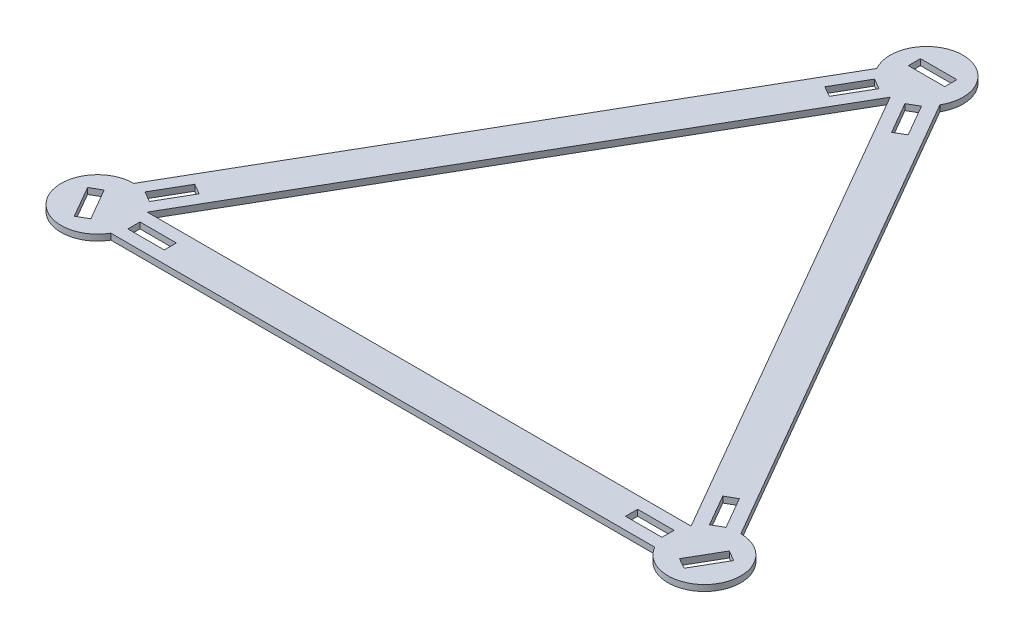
ISO-10303-21;
HEADER;
FILE_DESCRIPTION(('STEP AP214'),'2;1');
FILE_NAME('part.step','',(''),(''),'','','');
FILE_SCHEMA(('AUTOMOTIVE_DESIGN { 1 0 10303 214 1 1 1 1 }'));
ENDSEC;
DATA;
#1=APPLICATION_CONTEXT('core data for automotive mechanical design processes');
#2=APPLICATION_PROTOCOL_DEFINITION('international standard','automotive_design',2000,#1);
#3=PRODUCT_CONTEXT('',#1,'mechanical');
#4=PRODUCT('Part','Part','',(#3));
#5=PRODUCT_RELATED_PRODUCT_CATEGORY('part','',(#4));
#6=PRODUCT_DEFINITION_FORMATION('','',#4);
#7=PRODUCT_DEFINITION_CONTEXT('part definition',#1,'design');
#8=PRODUCT_DEFINITION('design','',#6,#7);
#9=PRODUCT_DEFINITION_SHAPE('','',#8);
#10=(LENGTH_UNIT() NAMED_UNIT(*) SI_UNIT(.MILLI.,.METRE.));
#11=(NAMED_UNIT(*) PLANE_ANGLE_UNIT() SI_UNIT($,.RADIAN.));
#12=(NAMED_UNIT(*) SI_UNIT($,.STERADIAN.) SOLID_ANGLE_UNIT());
#13=UNCERTAINTY_MEASURE_WITH_UNIT(LENGTH_MEASURE(1.E-05),#10,'distance_accuracy_value','');
#14=(GEOMETRIC_REPRESENTATION_CONTEXT(3) GLOBAL_UNCERTAINTY_ASSIGNED_CONTEXT((#13)) GLOBAL_UNIT_ASSIGNED_CONTEXT((#10,
#11,#12)) REPRESENTATION_CONTEXT('',''));
#15=CARTESIAN_POINT('',(0.,0.,0.));
#16=DIRECTION('',(0.,0.,1.));
#17=DIRECTION('',(1.,0.,0.));
#18=AXIS2_PLACEMENT_3D('',#15,#16,#17);
#19=CARTESIAN_POINT('',(-12.9903810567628,5.,-7.49999999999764));
#20=DIRECTION('',(0.866025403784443,0.,0.499999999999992));
#21=DIRECTION('',(0.499999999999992,0.,-0.866025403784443));
#22=AXIS2_PLACEMENT_3D('',#19,#20,#21);
#23=PLANE('',#22);
#24=DIRECTION('',(-0.499999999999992,0.,0.866025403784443));
#25=VECTOR('',#24,1.);
#26=CARTESIAN_POINT('',(-12.9903810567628,0.,-7.49999999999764));
#27=LINE('',#26,#25);
#28=CARTESIAN_POINT('',(224.019237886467,0.,-418.012701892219));
#29=VERTEX_POINT('',#28);
#30=CARTESIAN_POINT('',(4.64732419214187E-12,0.,-29.9999999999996));
#31=VERTEX_POINT('',#30);
#32=EDGE_CURVE('E465',#29,#31,#27,.T.);
#33=ORIENTED_EDGE('',*,*,#32,.T.);
#34=DIRECTION('',(0.,-1.,0.));
#35=VECTOR('',#34,1.);
#36=CARTESIAN_POINT('',(4.64732419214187E-12,5.,-29.9999999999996));
#37=LINE('',#36,#35);
#38=CARTESIAN_POINT('',(4.64732419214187E-12,5.,-29.9999999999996));
#39=VERTEX_POINT('',#38);
#40=EDGE_CURVE('E11',#39,#31,#37,.T.);
#41=ORIENTED_EDGE('',*,*,#40,.F.);
#42=DIRECTION('',(-0.499999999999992,0.,0.866025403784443));
#43=VECTOR('',#42,1.);
#44=CARTESIAN_POINT('',(-12.9903810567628,5.,-7.49999999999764));
#45=LINE('',#44,#43);
#46=CARTESIAN_POINT('',(224.019237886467,5.,-418.012701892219));
#47=VERTEX_POINT('',#46);
#48=EDGE_CURVE('E772',#47,#39,#45,.T.);
#49=ORIENTED_EDGE('',*,*,#48,.F.);
#50=DIRECTION('',(0.,-1.,0.));
#51=VECTOR('',#50,1.);
#52=CARTESIAN_POINT('',(224.019237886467,5.,-418.012701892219));
#53=LINE('',#52,#51);
#54=EDGE_CURVE('E477',#47,#29,#53,.T.);
#55=ORIENTED_EDGE('',*,*,#54,.T.);
#56=EDGE_LOOP('',(#33,#41,#49,#55));
#57=FACE_BOUND('',#56,.T.);
#58=ADVANCED_FACE('F35',(#57),#23,.F.);
#59=CARTESIAN_POINT('',(4.21884749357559E-12,5.,4.5102810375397E-13));
#60=DIRECTION('',(0.,-1.,0.));
#61=DIRECTION('',(0.,0.,-1.));
#62=AXIS2_PLACEMENT_3D('',#59,#60,#61);
#63=CYLINDRICAL_SURFACE('',#62,30.0000000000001);
#64=CARTESIAN_POINT('',(4.21884749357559E-12,0.,4.5102810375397E-13));
#65=DIRECTION('',(0.,1.,0.));
#66=DIRECTION('',(0.,0.,1.));
#67=AXIS2_PLACEMENT_3D('',#64,#65,#66);
#68=CIRCLE('',#67,30.0000000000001);
#69=CARTESIAN_POINT('',(25.9807621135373,0.,15.0000000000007));
#70=VERTEX_POINT('',#69);
#71=EDGE_CURVE('E468',#31,#70,#68,.T.);
#72=ORIENTED_EDGE('',*,*,#71,.T.);
#73=DIRECTION('',(0.,-1.,0.));
#74=VECTOR('',#73,1.);
#75=CARTESIAN_POINT('',(25.9807621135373,5.,15.0000000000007));
#76=LINE('',#75,#74);
#77=CARTESIAN_POINT('',(25.9807621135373,5.,15.0000000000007));
#78=VERTEX_POINT('',#77);
#79=EDGE_CURVE('E45',#78,#70,#76,.T.);
#80=ORIENTED_EDGE('',*,*,#79,.F.);
#81=CARTESIAN_POINT('',(4.21884749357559E-12,5.,4.5102810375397E-13));
#82=DIRECTION('',(0.,1.,0.));
#83=DIRECTION('',(0.,0.,1.));
#84=AXIS2_PLACEMENT_3D('',#81,#82,#83);
#85=CIRCLE('',#84,30.0000000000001);
#86=EDGE_CURVE('E773',#39,#78,#85,.T.);
#87=ORIENTED_EDGE('',*,*,#86,.F.);
#88=ORIENTED_EDGE('',*,*,#40,.T.);
#89=EDGE_LOOP('',(#72,#80,#87,#88));
#90=FACE_BOUND('',#89,.T.);
#91=ADVANCED_FACE('F601',(#90),#63,.T.);
#92=CARTESIAN_POINT('',(1.05236015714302E-13,5.,15.0000000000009));
#93=DIRECTION('',(0.,0.,-1.));
#94=DIRECTION('',(-1.,0.,0.));
#95=AXIS2_PLACEMENT_3D('',#92,#93,#94);
#96=PLANE('',#95);
#97=DIRECTION('',(1.,0.,0.));
#98=VECTOR('',#97,1.);
#99=CARTESIAN_POINT('',(1.05236015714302E-13,0.,15.0000000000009));
#100=LINE('',#99,#98);
#101=CARTESIAN_POINT('',(474.019237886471,0.,14.9999999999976));
#102=VERTEX_POINT('',#101);
#103=EDGE_CURVE('E470',#70,#102,#100,.T.);
#104=ORIENTED_EDGE('',*,*,#103,.T.);
#105=DIRECTION('',(0.,-1.,0.));
#106=VECTOR('',#105,1.);
#107=CARTESIAN_POINT('',(474.019237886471,5.,14.9999999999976));
#108=LINE('',#107,#106);
#109=CARTESIAN_POINT('',(474.019237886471,5.,14.9999999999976));
#110=VERTEX_POINT('',#109);
#111=EDGE_CURVE('E349',#110,#102,#108,.T.);
#112=ORIENTED_EDGE('',*,*,#111,.F.);
#113=DIRECTION('',(1.,0.,0.));
#114=VECTOR('',#113,1.);
#115=CARTESIAN_POINT('',(1.05236015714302E-13,5.,15.0000000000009));
#116=LINE('',#115,#114);
#117=EDGE_CURVE('E336',#78,#110,#116,.T.);
#118=ORIENTED_EDGE('',*,*,#117,.F.);
#119=ORIENTED_EDGE('',*,*,#79,.T.);
#120=EDGE_LOOP('',(#104,#112,#118,#119));
#121=FACE_BOUND('',#120,.T.);
#122=ADVANCED_FACE('F607',(#121),#96,.F.);
#123=CARTESIAN_POINT('',(500.000000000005,5.,-2.16493489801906E-12));
#124=DIRECTION('',(0.,-1.,0.));
#125=DIRECTION('',(0.,0.,-1.));
#126=AXIS2_PLACEMENT_3D('',#123,#124,#125);
#127=CYLINDRICAL_SURFACE('',#126,30.0000000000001);
#128=CARTESIAN_POINT('',(500.000000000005,0.,-2.16493489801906E-12));
#129=DIRECTION('',(0.,1.,0.));
#130=DIRECTION('',(0.,0.,1.));
#131=AXIS2_PLACEMENT_3D('',#128,#129,#130);
#132=CIRCLE('',#131,30.0000000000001);
#133=CARTESIAN_POINT('',(500.000000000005,0.,-30.0000000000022));
#134=VERTEX_POINT('',#133);
#135=EDGE_CURVE('E345',#102,#134,#132,.T.);
#136=ORIENTED_EDGE('',*,*,#135,.T.);
#137=DIRECTION('',(0.,-1.,0.));
#138=VECTOR('',#137,1.);
#139=CARTESIAN_POINT('',(500.000000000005,5.,-30.0000000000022));
#140=LINE('',#139,#138);
#141=CARTESIAN_POINT('',(500.000000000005,5.,-30.0000000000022));
#142=VERTEX_POINT('',#141);
#143=EDGE_CURVE('E342',#142,#134,#140,.T.);
#144=ORIENTED_EDGE('',*,*,#143,.F.);
#145=CARTESIAN_POINT('',(500.000000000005,5.,-2.16493489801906E-12));
#146=DIRECTION('',(0.,1.,0.));
#147=DIRECTION('',(0.,0.,1.));
#148=AXIS2_PLACEMENT_3D('',#145,#146,#147);
#149=CIRCLE('',#148,30.0000000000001);
#150=EDGE_CURVE('E330',#110,#142,#149,.T.);
#151=ORIENTED_EDGE('',*,*,#150,.F.);
#152=ORIENTED_EDGE('',*,*,#111,.T.);
#153=EDGE_LOOP('',(#136,#144,#151,#152));
#154=FACE_BOUND('',#153,.T.);
#155=ADVANCED_FACE('F343',(#154),#127,.T.);
#156=CARTESIAN_POINT('',(387.990381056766,5.,-224.006350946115));
#157=DIRECTION('',(0.866025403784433,0.,-0.50000000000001));
#158=DIRECTION('',(-0.50000000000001,0.,-0.866025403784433));
#159=AXIS2_PLACEMENT_3D('',#156,#157,#158);
#160=PLANE('',#159);
#161=DIRECTION('',(0.50000000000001,0.,0.866025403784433));
#162=VECTOR('',#161,1.);
#163=CARTESIAN_POINT('',(387.990381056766,0.,-224.006350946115));
#164=LINE('',#163,#162);
#165=CARTESIAN_POINT('',(275.980762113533,0.,-418.012701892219));
#166=VERTEX_POINT('',#165);
#167=EDGE_CURVE('E473',#166,#134,#164,.T.);
#168=ORIENTED_EDGE('',*,*,#167,.F.);
#169=DIRECTION('',(0.,-1.,0.));
#170=VECTOR('',#169,1.);
#171=CARTESIAN_POINT('',(275.980762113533,5.,-418.012701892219));
#172=LINE('',#171,#170);
#173=CARTESIAN_POINT('',(275.980762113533,5.,-418.012701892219));
#174=VERTEX_POINT('',#173);
#175=EDGE_CURVE('E193',#174,#166,#172,.T.);
#176=ORIENTED_EDGE('',*,*,#175,.F.);
#177=DIRECTION('',(0.50000000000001,0.,0.866025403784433));
#178=VECTOR('',#177,1.);
#179=CARTESIAN_POINT('',(387.990381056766,5.,-224.006350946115));
#180=LINE('',#179,#178);
#181=EDGE_CURVE('E334',#174,#142,#180,.T.);
#182=ORIENTED_EDGE('',*,*,#181,.T.);
#183=ORIENTED_EDGE('',*,*,#143,.T.);
#184=EDGE_LOOP('',(#168,#176,#182,#183));
#185=FACE_BOUND('',#184,.T.);
#186=ADVANCED_FACE('F351',(#185),#160,.T.);
#187=CARTESIAN_POINT('',(15.0000000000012,5.,-25.9807621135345));
#188=DIRECTION('',(0.500000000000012,0.,-0.866025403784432));
#189=DIRECTION('',(-0.866025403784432,0.,-0.500000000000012));
#190=AXIS2_PLACEMENT_3D('',#187,#188,#189);
#191=PLANE('',#190);
#192=DIRECTION('',(0.866025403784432,0.,0.500000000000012));
#193=VECTOR('',#192,1.);
#194=CARTESIAN_POINT('',(15.0000000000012,0.,-25.9807621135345));
#195=LINE('',#194,#193);
#196=CARTESIAN_POINT('',(10.6698729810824,0.,-28.4807621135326));
#197=VERTEX_POINT('',#196);
#198=CARTESIAN_POINT('',(19.3301270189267,0.,-23.4807621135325));
#199=VERTEX_POINT('',#198);
#200=EDGE_CURVE('E453',#197,#199,#195,.T.);
#201=ORIENTED_EDGE('',*,*,#200,.F.);
#202=DIRECTION('',(0.,-1.,0.));
#203=VECTOR('',#202,1.);
#204=CARTESIAN_POINT('',(10.6698729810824,5.,-28.4807621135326));
#205=LINE('',#204,#203);
#206=CARTESIAN_POINT('',(10.6698729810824,5.,-28.4807621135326));
#207=VERTEX_POINT('',#206);
#208=EDGE_CURVE('E479',#207,#197,#205,.T.);
#209=ORIENTED_EDGE('',*,*,#208,.F.);
#210=DIRECTION('',(0.866025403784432,0.,0.500000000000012));
#211=VECTOR('',#210,1.);
#212=CARTESIAN_POINT('',(15.0000000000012,5.,-25.9807621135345));
#213=LINE('',#212,#211);
#214=CARTESIAN_POINT('',(19.3301270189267,5.,-23.4807621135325));
#215=VERTEX_POINT('',#214);
#216=EDGE_CURVE('E786',#207,#215,#213,.T.);
#217=ORIENTED_EDGE('',*,*,#216,.T.);
#218=DIRECTION('',(0.,-1.,0.));
#219=VECTOR('',#218,1.);
#220=CARTESIAN_POINT('',(19.3301270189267,5.,-23.4807621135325));
#221=LINE('',#220,#219);
#222=EDGE_CURVE('E484',#215,#199,#221,.T.);
#223=ORIENTED_EDGE('',*,*,#222,.T.);
#224=EDGE_LOOP('',(#201,#209,#217,#223));
#225=FACE_BOUND('',#224,.T.);
#226=ADVANCED_FACE('F620',(#225),#191,.T.);
#227=CARTESIAN_POINT('',(-4.33012701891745,5.,-2.49999999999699));
#228=DIRECTION('',(0.866025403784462,0.,0.499999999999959));
#229=DIRECTION('',(0.499999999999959,0.,-0.866025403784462));
#230=AXIS2_PLACEMENT_3D('',#227,#228,#229);
#231=PLANE('',#230);
#232=DIRECTION('',(-0.499999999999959,0.,0.866025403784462));
#233=VECTOR('',#232,1.);
#234=CARTESIAN_POINT('',(-4.33012701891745,0.,-2.49999999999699));
#235=LINE('',#234,#233);
#236=CARTESIAN_POINT('',(25.6698729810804,0.,-54.4615242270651));
#237=VERTEX_POINT('',#236);
#238=EDGE_CURVE('E456',#237,#197,#235,.T.);
#239=ORIENTED_EDGE('',*,*,#238,.F.);
#240=DIRECTION('',(0.,-1.,0.));
#241=VECTOR('',#240,1.);
#242=CARTESIAN_POINT('',(25.6698729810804,5.,-54.4615242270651));
#243=LINE('',#242,#241);
#244=CARTESIAN_POINT('',(25.6698729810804,5.,-54.4615242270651));
#245=VERTEX_POINT('',#244);
#246=EDGE_CURVE('E489',#245,#237,#243,.T.);
#247=ORIENTED_EDGE('',*,*,#246,.F.);
#248=DIRECTION('',(-0.499999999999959,0.,0.866025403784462));
#249=VECTOR('',#248,1.);
#250=CARTESIAN_POINT('',(-4.33012701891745,5.,-2.49999999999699));
#251=LINE('',#250,#249);
#252=EDGE_CURVE('E783',#245,#207,#251,.T.);
#253=ORIENTED_EDGE('',*,*,#252,.T.);
#254=ORIENTED_EDGE('',*,*,#208,.T.);
#255=EDGE_LOOP('',(#239,#247,#253,#254));
#256=FACE_BOUND('',#255,.T.);
#257=ADVANCED_FACE('F616',(#256),#231,.T.);
#258=CARTESIAN_POINT('',(30.0000000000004,5.,-51.9615242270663));
#259=DIRECTION('',(-0.500000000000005,0.,0.866025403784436));
#260=DIRECTION('',(0.866025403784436,0.,0.500000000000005));
#261=AXIS2_PLACEMENT_3D('',#258,#259,#260);
#262=PLANE('',#261);
#263=DIRECTION('',(-0.866025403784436,0.,-0.500000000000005));
#264=VECTOR('',#263,1.);
#265=CARTESIAN_POINT('',(30.0000000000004,0.,-51.9615242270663));
#266=LINE('',#265,#264);
#267=CARTESIAN_POINT('',(34.330127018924,0.,-49.4615242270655));
#268=VERTEX_POINT('',#267);
#269=EDGE_CURVE('E459',#268,#237,#266,.T.);
#270=ORIENTED_EDGE('',*,*,#269,.F.);
#271=DIRECTION('',(0.,-1.,0.));
#272=VECTOR('',#271,1.);
#273=CARTESIAN_POINT('',(34.330127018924,5.,-49.4615242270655));
#274=LINE('',#273,#272);
#275=CARTESIAN_POINT('',(34.330127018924,5.,-49.4615242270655));
#276=VERTEX_POINT('',#275);
#277=EDGE_CURVE('E486',#276,#268,#274,.T.);
#278=ORIENTED_EDGE('',*,*,#277,.F.);
#279=DIRECTION('',(-0.866025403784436,0.,-0.500000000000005));
#280=VECTOR('',#279,1.);
#281=CARTESIAN_POINT('',(30.0000000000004,5.,-51.9615242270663));
#282=LINE('',#281,#280);
#283=EDGE_CURVE('E778',#276,#245,#282,.T.);
#284=ORIENTED_EDGE('',*,*,#283,.T.);
#285=ORIENTED_EDGE('',*,*,#246,.T.);
#286=EDGE_LOOP('',(#270,#278,#284,#285));
#287=FACE_BOUND('',#286,.T.);
#288=ADVANCED_FACE('F612',(#287),#262,.T.);
#289=CARTESIAN_POINT('',(60.0000000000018,5.,0.));
#290=DIRECTION('',(1.,0.,0.));
#291=DIRECTION('',(0.,0.,-1.));
#292=AXIS2_PLACEMENT_3D('',#289,#290,#291);
#293=PLANE('',#292);
#294=DIRECTION('',(0.,0.,1.));
#295=VECTOR('',#294,1.);
#296=CARTESIAN_POINT('',(60.0000000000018,0.,0.));
#297=LINE('',#296,#295);
#298=CARTESIAN_POINT('',(60.0000000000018,0.,-4.99999999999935));
#299=VERTEX_POINT('',#298);
#300=CARTESIAN_POINT('',(60.0000000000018,0.,4.99999999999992));
#301=VERTEX_POINT('',#300);
#302=EDGE_CURVE('E444',#299,#301,#297,.T.);
#303=ORIENTED_EDGE('',*,*,#302,.T.);
#304=DIRECTION('',(0.,-1.,0.));
#305=VECTOR('',#304,1.);
#306=CARTESIAN_POINT('',(60.0000000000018,5.,4.99999999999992));
#307=LINE('',#306,#305);
#308=CARTESIAN_POINT('',(60.0000000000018,5.,4.99999999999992));
#309=VERTEX_POINT('',#308);
#310=EDGE_CURVE('E487',#309,#301,#307,.T.);
#311=ORIENTED_EDGE('',*,*,#310,.F.);
#312=DIRECTION('',(0.,0.,1.));
#313=VECTOR('',#312,1.);
#314=CARTESIAN_POINT('',(60.0000000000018,5.,0.));
#315=LINE('',#314,#313);
#316=CARTESIAN_POINT('',(60.0000000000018,5.,-4.99999999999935));
#317=VERTEX_POINT('',#316);
#318=EDGE_CURVE('E795',#317,#309,#315,.T.);
#319=ORIENTED_EDGE('',*,*,#318,.F.);
#320=DIRECTION('',(0.,-1.,0.));
#321=VECTOR('',#320,1.);
#322=CARTESIAN_POINT('',(60.0000000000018,5.,-4.99999999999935));
#323=LINE('',#322,#321);
#324=EDGE_CURVE('E492',#317,#299,#323,.T.);
#325=ORIENTED_EDGE('',*,*,#324,.T.);
#326=EDGE_LOOP('',(#303,#311,#319,#325));
#327=FACE_BOUND('',#326,.T.);
#328=ADVANCED_FACE('F615',(#327),#293,.F.);
#329=CARTESIAN_POINT('',(1.34874750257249E-13,5.,5.00000000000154));
#330=DIRECTION('',(0.,0.,1.));
#331=DIRECTION('',(1.,0.,0.));
#332=AXIS2_PLACEMENT_3D('',#329,#330,#331);
#333=PLANE('',#332);
#334=DIRECTION('',(-1.,0.,0.));
#335=VECTOR('',#334,1.);
#336=CARTESIAN_POINT('',(1.34874750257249E-13,0.,5.00000000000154));
#337=LINE('',#336,#335);
#338=CARTESIAN_POINT('',(30.0000000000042,0.,5.00000000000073));
#339=VERTEX_POINT('',#338);
#340=EDGE_CURVE('E447',#301,#339,#337,.T.);
#341=ORIENTED_EDGE('',*,*,#340,.T.);
#342=DIRECTION('',(0.,-1.,0.));
#343=VECTOR('',#342,1.);
#344=CARTESIAN_POINT('',(30.0000000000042,5.,5.00000000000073));
#345=LINE('',#344,#343);
#346=CARTESIAN_POINT('',(30.0000000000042,5.,5.00000000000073));
#347=VERTEX_POINT('',#346);
#348=EDGE_CURVE('E499',#347,#339,#345,.T.);
#349=ORIENTED_EDGE('',*,*,#348,.F.);
#350=DIRECTION('',(-1.,0.,0.));
#351=VECTOR('',#350,1.);
#352=CARTESIAN_POINT('',(1.34874750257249E-13,5.,5.00000000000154));
#353=LINE('',#352,#351);
#354=EDGE_CURVE('E793',#309,#347,#353,.T.);
#355=ORIENTED_EDGE('',*,*,#354,.F.);
#356=ORIENTED_EDGE('',*,*,#310,.T.);
#357=EDGE_LOOP('',(#341,#349,#355,#356));
#358=FACE_BOUND('',#357,.T.);
#359=ADVANCED_FACE('F633',(#358),#333,.F.);
#360=CARTESIAN_POINT('',(30.0000000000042,5.,3.33066907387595E-13));
#361=DIRECTION('',(-1.,0.,0.));
#362=DIRECTION('',(0.,0.,1.));
#363=AXIS2_PLACEMENT_3D('',#360,#361,#362);
#364=PLANE('',#363);
#365=DIRECTION('',(0.,0.,-1.));
#366=VECTOR('',#365,1.);
#367=CARTESIAN_POINT('',(30.0000000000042,0.,3.33066907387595E-13));
#368=LINE('',#367,#366);
#369=CARTESIAN_POINT('',(30.0000000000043,0.,-4.99999999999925));
#370=VERTEX_POINT('',#369);
#371=EDGE_CURVE('E449',#339,#370,#368,.T.);
#372=ORIENTED_EDGE('',*,*,#371,.T.);
#373=DIRECTION('',(0.,-1.,0.));
#374=VECTOR('',#373,1.);
#375=CARTESIAN_POINT('',(30.0000000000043,5.,-4.99999999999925));
#376=LINE('',#375,#374);
#377=CARTESIAN_POINT('',(30.0000000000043,5.,-4.99999999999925));
#378=VERTEX_POINT('',#377);
#379=EDGE_CURVE('E495',#378,#370,#376,.T.);
#380=ORIENTED_EDGE('',*,*,#379,.F.);
#381=DIRECTION('',(0.,0.,-1.));
#382=VECTOR('',#381,1.);
#383=CARTESIAN_POINT('',(30.0000000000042,5.,3.33066907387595E-13));
#384=LINE('',#383,#382);
#385=EDGE_CURVE('E791',#347,#378,#384,.T.);
#386=ORIENTED_EDGE('',*,*,#385,.F.);
#387=ORIENTED_EDGE('',*,*,#348,.T.);
#388=EDGE_LOOP('',(#372,#380,#386,#387));
#389=FACE_BOUND('',#388,.T.);
#390=ADVANCED_FACE('F629',(#389),#364,.F.);
#391=CARTESIAN_POINT('',(470.000000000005,5.,0.));
#392=DIRECTION('',(-1.,0.,0.));
#393=DIRECTION('',(0.,0.,1.));
#394=AXIS2_PLACEMENT_3D('',#391,#392,#393);
#395=PLANE('',#394);
#396=DIRECTION('',(0.,0.,-1.));
#397=VECTOR('',#396,1.);
#398=CARTESIAN_POINT('',(470.000000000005,0.,0.));
#399=LINE('',#398,#397);
#400=CARTESIAN_POINT('',(470.000000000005,0.,4.99999999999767));
#401=VERTEX_POINT('',#400);
#402=CARTESIAN_POINT('',(470.000000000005,0.,-5.00000000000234));
#403=VERTEX_POINT('',#402);
#404=EDGE_CURVE('E432',#401,#403,#399,.T.);
#405=ORIENTED_EDGE('',*,*,#404,.F.);
#406=DIRECTION('',(0.,-1.,0.));
#407=VECTOR('',#406,1.);
#408=CARTESIAN_POINT('',(470.000000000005,5.,4.99999999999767));
#409=LINE('',#408,#407);
#410=CARTESIAN_POINT('',(470.000000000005,5.,4.99999999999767));
#411=VERTEX_POINT('',#410);
#412=EDGE_CURVE('E496',#411,#401,#409,.T.);
#413=ORIENTED_EDGE('',*,*,#412,.F.);
#414=DIRECTION('',(0.,0.,-1.));
#415=VECTOR('',#414,1.);
#416=CARTESIAN_POINT('',(470.000000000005,5.,0.));
#417=LINE('',#416,#415);
#418=CARTESIAN_POINT('',(470.000000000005,5.,-5.00000000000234));
#419=VERTEX_POINT('',#418);
#420=EDGE_CURVE('E807',#411,#419,#417,.T.);
#421=ORIENTED_EDGE('',*,*,#420,.T.);
#422=DIRECTION('',(0.,-1.,0.));
#423=VECTOR('',#422,1.);
#424=CARTESIAN_POINT('',(470.000000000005,5.,-5.00000000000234));
#425=LINE('',#424,#423);
#426=EDGE_CURVE('E504',#419,#403,#425,.T.);
#427=ORIENTED_EDGE('',*,*,#426,.T.);
#428=EDGE_LOOP('',(#405,#413,#421,#427));
#429=FACE_BOUND('',#428,.T.);
#430=ADVANCED_FACE('F632',(#429),#395,.T.);
#431=CARTESIAN_POINT('',(0.,5.,4.99999999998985));
#432=DIRECTION('',(0.,0.,-1.));
#433=DIRECTION('',(-1.,0.,0.));
#434=AXIS2_PLACEMENT_3D('',#431,#432,#433);
#435=PLANE('',#434);
#436=DIRECTION('',(1.,0.,0.));
#437=VECTOR('',#436,1.);
#438=CARTESIAN_POINT('',(0.,0.,4.99999999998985));
#439=LINE('',#438,#437);
#440=CARTESIAN_POINT('',(440.000000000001,0.,4.99999999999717));
#441=VERTEX_POINT('',#440);
#442=EDGE_CURVE('E435',#441,#401,#439,.T.);
#443=ORIENTED_EDGE('',*,*,#442,.F.);
#444=DIRECTION('',(0.,-1.,0.));
#445=VECTOR('',#444,1.);
#446=CARTESIAN_POINT('',(440.000000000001,5.,4.99999999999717));
#447=LINE('',#446,#445);
#448=CARTESIAN_POINT('',(440.000000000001,5.,4.99999999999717));
#449=VERTEX_POINT('',#448);
#450=EDGE_CURVE('E509',#449,#441,#447,.T.);
#451=ORIENTED_EDGE('',*,*,#450,.F.);
#452=DIRECTION('',(1.,0.,0.));
#453=VECTOR('',#452,1.);
#454=CARTESIAN_POINT('',(0.,5.,4.99999999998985));
#455=LINE('',#454,#453);
#456=EDGE_CURVE('E804',#449,#411,#455,.T.);
#457=ORIENTED_EDGE('',*,*,#456,.T.);
#458=ORIENTED_EDGE('',*,*,#412,.T.);
#459=EDGE_LOOP('',(#443,#451,#457,#458));
#460=FACE_BOUND('',#459,.T.);
#461=ADVANCED_FACE('F649',(#460),#435,.T.);
#462=CARTESIAN_POINT('',(440.000000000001,5.,0.));
#463=DIRECTION('',(1.,0.,0.));
#464=DIRECTION('',(0.,0.,-1.));
#465=AXIS2_PLACEMENT_3D('',#462,#463,#464);
#466=PLANE('',#465);
#467=DIRECTION('',(0.,0.,1.));
#468=VECTOR('',#467,1.);
#469=CARTESIAN_POINT('',(440.000000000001,0.,0.));
#470=LINE('',#469,#468);
#471=CARTESIAN_POINT('',(440.000000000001,0.,-5.00000000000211));
#472=VERTEX_POINT('',#471);
#473=EDGE_CURVE('E438',#472,#441,#470,.T.);
#474=ORIENTED_EDGE('',*,*,#473,.F.);
#475=DIRECTION('',(0.,-1.,0.));
#476=VECTOR('',#475,1.);
#477=CARTESIAN_POINT('',(440.000000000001,5.,-5.00000000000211));
#478=LINE('',#477,#476);
#479=CARTESIAN_POINT('',(440.000000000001,5.,-5.00000000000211));
#480=VERTEX_POINT('',#479);
#481=EDGE_CURVE('E506',#480,#472,#478,.T.);
#482=ORIENTED_EDGE('',*,*,#481,.F.);
#483=DIRECTION('',(0.,0.,1.));
#484=VECTOR('',#483,1.);
#485=CARTESIAN_POINT('',(440.000000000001,5.,0.));
#486=LINE('',#485,#484);
#487=EDGE_CURVE('E801',#480,#449,#486,.T.);
#488=ORIENTED_EDGE('',*,*,#487,.T.);
#489=ORIENTED_EDGE('',*,*,#450,.T.);
#490=EDGE_LOOP('',(#474,#482,#488,#489));
#491=FACE_BOUND('',#490,.T.);
#492=ADVANCED_FACE('F645',(#491),#466,.T.);
#493=CARTESIAN_POINT('',(95.0000000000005,5.,164.544826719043));
#494=DIRECTION('',(-0.500000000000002,0.,-0.866025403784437));
#495=DIRECTION('',(-0.866025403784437,0.,0.500000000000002));
#496=AXIS2_PLACEMENT_3D('',#493,#494,#495);
#497=PLANE('',#496);
#498=DIRECTION('',(0.866025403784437,0.,-0.500000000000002));
#499=VECTOR('',#498,1.);
#500=CARTESIAN_POINT('',(95.0000000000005,0.,164.544826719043));
#501=LINE('',#500,#499);
#502=CARTESIAN_POINT('',(465.669872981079,0.,-49.4615242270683));
#503=VERTEX_POINT('',#502);
#504=CARTESIAN_POINT('',(474.330127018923,0.,-54.461524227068));
#505=VERTEX_POINT('',#504);
#506=EDGE_CURVE('E423',#503,#505,#501,.T.);
#507=ORIENTED_EDGE('',*,*,#506,.T.);
#508=DIRECTION('',(0.,-1.,0.));
#509=VECTOR('',#508,1.);
#510=CARTESIAN_POINT('',(474.330127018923,5.,-54.461524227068));
#511=LINE('',#510,#509);
#512=CARTESIAN_POINT('',(474.330127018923,5.,-54.461524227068));
#513=VERTEX_POINT('',#512);
#514=EDGE_CURVE('E507',#513,#505,#511,.T.);
#515=ORIENTED_EDGE('',*,*,#514,.F.);
#516=DIRECTION('',(0.866025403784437,0.,-0.500000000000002));
#517=VECTOR('',#516,1.);
#518=CARTESIAN_POINT('',(95.0000000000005,5.,164.544826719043));
#519=LINE('',#518,#517);
#520=CARTESIAN_POINT('',(465.669872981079,5.,-49.4615242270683));
#521=VERTEX_POINT('',#520);
#522=EDGE_CURVE('E816',#521,#513,#519,.T.);
#523=ORIENTED_EDGE('',*,*,#522,.F.);
#524=DIRECTION('',(0.,-1.,0.));
#525=VECTOR('',#524,1.);
#526=CARTESIAN_POINT('',(465.669872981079,5.,-49.4615242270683));
#527=LINE('',#526,#525);
#528=EDGE_CURVE('E512',#521,#503,#527,.T.);
#529=ORIENTED_EDGE('',*,*,#528,.T.);
#530=EDGE_LOOP('',(#507,#515,#523,#529));
#531=FACE_BOUND('',#530,.T.);
#532=ADVANCED_FACE('F648',(#531),#497,.F.);
#533=CARTESIAN_POINT('',(379.330127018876,5.,-219.006350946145));
#534=DIRECTION('',(0.866025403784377,0.,-0.500000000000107));
#535=DIRECTION('',(-0.500000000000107,0.,-0.866025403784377));
#536=AXIS2_PLACEMENT_3D('',#533,#534,#535);
#537=PLANE('',#536);
#538=DIRECTION('',(0.500000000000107,0.,0.866025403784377));
#539=VECTOR('',#538,1.);
#540=CARTESIAN_POINT('',(379.330127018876,0.,-219.006350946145));
#541=LINE('',#540,#539);
#542=CARTESIAN_POINT('',(489.330127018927,0.,-28.4807621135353));
#543=VERTEX_POINT('',#542);
#544=EDGE_CURVE('E426',#505,#543,#541,.T.);
#545=ORIENTED_EDGE('',*,*,#544,.T.);
#546=DIRECTION('',(0.,-1.,0.));
#547=VECTOR('',#546,1.);
#548=CARTESIAN_POINT('',(489.330127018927,5.,-28.4807621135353));
#549=LINE('',#548,#547);
#550=CARTESIAN_POINT('',(489.330127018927,5.,-28.4807621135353));
#551=VERTEX_POINT('',#550);
#552=EDGE_CURVE('E519',#551,#543,#549,.T.);
#553=ORIENTED_EDGE('',*,*,#552,.F.);
#554=DIRECTION('',(0.500000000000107,0.,0.866025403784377));
#555=VECTOR('',#554,1.);
#556=CARTESIAN_POINT('',(379.330127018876,5.,-219.006350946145));
#557=LINE('',#556,#555);
#558=EDGE_CURVE('E814',#513,#551,#557,.T.);
#559=ORIENTED_EDGE('',*,*,#558,.F.);
#560=ORIENTED_EDGE('',*,*,#514,.T.);
#561=EDGE_LOOP('',(#545,#553,#559,#560));
#562=FACE_BOUND('',#561,.T.);
#563=ADVANCED_FACE('F665',(#562),#537,.F.);
#564=CARTESIAN_POINT('',(109.999999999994,5.,190.525588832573));
#565=DIRECTION('',(0.499999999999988,0.,0.866025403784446));
#566=DIRECTION('',(0.866025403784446,0.,-0.499999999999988));
#567=AXIS2_PLACEMENT_3D('',#564,#565,#566);
#568=PLANE('',#567);
#569=DIRECTION('',(-0.866025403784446,0.,0.499999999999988));
#570=VECTOR('',#569,1.);
#571=CARTESIAN_POINT('',(109.999999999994,0.,190.525588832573));
#572=LINE('',#571,#570);
#573=CARTESIAN_POINT('',(480.669872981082,0.,-23.4807621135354));
#574=VERTEX_POINT('',#573);
#575=EDGE_CURVE('E428',#543,#574,#572,.T.);
#576=ORIENTED_EDGE('',*,*,#575,.T.);
#577=DIRECTION('',(0.,-1.,0.));
#578=VECTOR('',#577,1.);
#579=CARTESIAN_POINT('',(480.669872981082,5.,-23.4807621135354));
#580=LINE('',#579,#578);
#581=CARTESIAN_POINT('',(480.669872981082,5.,-23.4807621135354));
#582=VERTEX_POINT('',#581);
#583=EDGE_CURVE('E515',#582,#574,#580,.T.);
#584=ORIENTED_EDGE('',*,*,#583,.F.);
#585=DIRECTION('',(-0.866025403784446,0.,0.499999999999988));
#586=VECTOR('',#585,1.);
#587=CARTESIAN_POINT('',(109.999999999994,5.,190.525588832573));
#588=LINE('',#587,#586);
#589=EDGE_CURVE('E812',#551,#582,#588,.T.);
#590=ORIENTED_EDGE('',*,*,#589,.F.);
#591=ORIENTED_EDGE('',*,*,#552,.T.);
#592=EDGE_LOOP('',(#576,#584,#590,#591));
#593=FACE_BOUND('',#592,.T.);
#594=ADVANCED_FACE('F661',(#593),#568,.F.);
#595=CARTESIAN_POINT('',(-110.,5.,-190.525588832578));
#596=DIRECTION('',(0.499999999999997,0.,0.866025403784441));
#597=DIRECTION('',(0.866025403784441,0.,-0.499999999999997));
#598=AXIS2_PLACEMENT_3D('',#595,#596,#597);
#599=PLANE('',#598);
#600=DIRECTION('',(-0.866025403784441,0.,0.499999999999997));
#601=VECTOR('',#600,1.);
#602=CARTESIAN_POINT('',(-110.,0.,-190.525588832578));
#603=LINE('',#602,#601);
#604=CARTESIAN_POINT('',(269.330127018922,0.,-409.531939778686));
#605=VERTEX_POINT('',#604);
#606=CARTESIAN_POINT('',(260.669872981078,0.,-404.531939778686));
#607=VERTEX_POINT('',#606);
#608=EDGE_CURVE('E411',#605,#607,#603,.T.);
#609=ORIENTED_EDGE('',*,*,#608,.F.);
#610=DIRECTION('',(0.,-1.,0.));
#611=VECTOR('',#610,1.);
#612=CARTESIAN_POINT('',(269.330127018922,5.,-409.531939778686));
#613=LINE('',#612,#611);
#614=CARTESIAN_POINT('',(269.330127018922,5.,-409.531939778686));
#615=VERTEX_POINT('',#614);
#616=EDGE_CURVE('E516',#615,#605,#613,.T.);
#617=ORIENTED_EDGE('',*,*,#616,.F.);
#618=DIRECTION('',(-0.866025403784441,0.,0.499999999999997));
#619=VECTOR('',#618,1.);
#620=CARTESIAN_POINT('',(-110.,5.,-190.525588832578));
#621=LINE('',#620,#619);
#622=CARTESIAN_POINT('',(260.669872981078,5.,-404.531939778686));
#623=VERTEX_POINT('',#622);
#624=EDGE_CURVE('E828',#615,#623,#621,.T.);
#625=ORIENTED_EDGE('',*,*,#624,.T.);
#626=DIRECTION('',(0.,-1.,0.));
#627=VECTOR('',#626,1.);
#628=CARTESIAN_POINT('',(260.669872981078,5.,-404.531939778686));
#629=LINE('',#628,#627);
#630=EDGE_CURVE('E524',#623,#607,#629,.T.);
#631=ORIENTED_EDGE('',*,*,#630,.T.);
#632=EDGE_LOOP('',(#609,#617,#625,#631));
#633=FACE_BOUND('',#632,.T.);
#634=ADVANCED_FACE('F664',(#633),#599,.T.);
#635=CARTESIAN_POINT('',(379.330127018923,5.,-219.006350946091));
#636=DIRECTION('',(-0.866025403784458,0.,0.499999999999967));
#637=DIRECTION('',(0.499999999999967,0.,0.866025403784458));
#638=AXIS2_PLACEMENT_3D('',#635,#636,#637);
#639=PLANE('',#638);
#640=DIRECTION('',(-0.499999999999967,0.,-0.866025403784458));
#641=VECTOR('',#640,1.);
#642=CARTESIAN_POINT('',(379.330127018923,0.,-219.006350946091));
#643=LINE('',#642,#641);
#644=CARTESIAN_POINT('',(284.330127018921,0.,-383.551177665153));
#645=VERTEX_POINT('',#644);
#646=EDGE_CURVE('E414',#645,#605,#643,.T.);
#647=ORIENTED_EDGE('',*,*,#646,.F.);
#648=DIRECTION('',(0.,-1.,0.));
#649=VECTOR('',#648,1.);
#650=CARTESIAN_POINT('',(284.330127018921,5.,-383.551177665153));
#651=LINE('',#650,#649);
#652=CARTESIAN_POINT('',(284.330127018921,5.,-383.551177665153));
#653=VERTEX_POINT('',#652);
#654=EDGE_CURVE('E529',#653,#645,#651,.T.);
#655=ORIENTED_EDGE('',*,*,#654,.F.);
#656=DIRECTION('',(-0.499999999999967,0.,-0.866025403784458));
#657=VECTOR('',#656,1.);
#658=CARTESIAN_POINT('',(379.330127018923,5.,-219.006350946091));
#659=LINE('',#658,#657);
#660=EDGE_CURVE('E825',#653,#615,#659,.T.);
#661=ORIENTED_EDGE('',*,*,#660,.T.);
#662=ORIENTED_EDGE('',*,*,#616,.T.);
#663=EDGE_LOOP('',(#647,#655,#661,#662));
#664=FACE_BOUND('',#663,.T.);
#665=ADVANCED_FACE('F681',(#664),#639,.T.);
#666=CARTESIAN_POINT('',(-95.0000000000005,5.,-164.544826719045));
#667=DIRECTION('',(-0.499999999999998,0.,-0.86602540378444));
#668=DIRECTION('',(-0.86602540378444,0.,0.499999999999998));
#669=AXIS2_PLACEMENT_3D('',#666,#667,#668);
#670=PLANE('',#669);
#671=DIRECTION('',(0.86602540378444,0.,-0.499999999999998));
#672=VECTOR('',#671,1.);
#673=CARTESIAN_POINT('',(-95.0000000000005,0.,-164.544826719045));
#674=LINE('',#673,#672);
#675=CARTESIAN_POINT('',(275.669872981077,0.,-378.551177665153));
#676=VERTEX_POINT('',#675);
#677=EDGE_CURVE('E417',#676,#645,#674,.T.);
#678=ORIENTED_EDGE('',*,*,#677,.F.);
#679=DIRECTION('',(0.,-1.,0.));
#680=VECTOR('',#679,1.);
#681=CARTESIAN_POINT('',(275.669872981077,5.,-378.551177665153));
#682=LINE('',#681,#680);
#683=CARTESIAN_POINT('',(275.669872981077,5.,-378.551177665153));
#684=VERTEX_POINT('',#683);
#685=EDGE_CURVE('E526',#684,#676,#682,.T.);
#686=ORIENTED_EDGE('',*,*,#685,.F.);
#687=DIRECTION('',(0.86602540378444,0.,-0.499999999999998));
#688=VECTOR('',#687,1.);
#689=CARTESIAN_POINT('',(-95.0000000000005,5.,-164.544826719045));
#690=LINE('',#689,#688);
#691=EDGE_CURVE('E822',#684,#653,#690,.T.);
#692=ORIENTED_EDGE('',*,*,#691,.T.);
#693=ORIENTED_EDGE('',*,*,#654,.T.);
#694=EDGE_LOOP('',(#678,#686,#692,#693));
#695=FACE_BOUND('',#694,.T.);
#696=ADVANCED_FACE('F677',(#695),#670,.T.);
#697=CARTESIAN_POINT('',(219.999999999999,5.,-381.051177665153));
#698=DIRECTION('',(-0.499999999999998,0.,0.86602540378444));
#699=DIRECTION('',(0.86602540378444,0.,0.499999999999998));
#700=AXIS2_PLACEMENT_3D('',#697,#698,#699);
#701=PLANE('',#700);
#702=DIRECTION('',(-0.86602540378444,0.,-0.499999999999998));
#703=VECTOR('',#702,1.);
#704=CARTESIAN_POINT('',(219.999999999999,0.,-381.051177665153));
#705=LINE('',#704,#703);
#706=CARTESIAN_POINT('',(224.330127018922,0.,-378.551177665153));
#707=VERTEX_POINT('',#706);
#708=CARTESIAN_POINT('',(215.669872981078,0.,-383.551177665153));
#709=VERTEX_POINT('',#708);
#710=EDGE_CURVE('E402',#707,#709,#705,.T.);
#711=ORIENTED_EDGE('',*,*,#710,.T.);
#712=DIRECTION('',(0.,-1.,0.));
#713=VECTOR('',#712,1.);
#714=CARTESIAN_POINT('',(215.669872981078,5.,-383.551177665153));
#715=LINE('',#714,#713);
#716=CARTESIAN_POINT('',(215.669872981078,5.,-383.551177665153));
#717=VERTEX_POINT('',#716);
#718=EDGE_CURVE('E527',#717,#709,#715,.T.);
#719=ORIENTED_EDGE('',*,*,#718,.F.);
#720=DIRECTION('',(-0.86602540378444,0.,-0.499999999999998));
#721=VECTOR('',#720,1.);
#722=CARTESIAN_POINT('',(219.999999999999,5.,-381.051177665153));
#723=LINE('',#722,#721);
#724=CARTESIAN_POINT('',(224.330127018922,5.,-378.551177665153));
#725=VERTEX_POINT('',#724);
#726=EDGE_CURVE('E837',#725,#717,#723,.T.);
#727=ORIENTED_EDGE('',*,*,#726,.F.);
#728=DIRECTION('',(0.,-1.,0.));
#729=VECTOR('',#728,1.);
#730=CARTESIAN_POINT('',(224.330127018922,5.,-378.551177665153));
#731=LINE('',#730,#729);
#732=EDGE_CURVE('E532',#725,#707,#731,.T.);
#733=ORIENTED_EDGE('',*,*,#732,.T.);
#734=EDGE_LOOP('',(#711,#719,#727,#733));
#735=FACE_BOUND('',#734,.T.);
#736=ADVANCED_FACE('F680',(#735),#701,.F.);
#737=CARTESIAN_POINT('',(-4.33012701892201,5.,-2.49999999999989));
#738=DIRECTION('',(-0.866025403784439,0.,-0.5));
#739=DIRECTION('',(-0.5,0.,0.866025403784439));
#740=AXIS2_PLACEMENT_3D('',#737,#738,#739);
#741=PLANE('',#740);
#742=DIRECTION('',(0.5,0.,-0.866025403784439));
#743=VECTOR('',#742,1.);
#744=CARTESIAN_POINT('',(-4.33012701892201,0.,-2.49999999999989));
#745=LINE('',#744,#743);
#746=CARTESIAN_POINT('',(230.669872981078,0.,-409.531939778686));
#747=VERTEX_POINT('',#746);
#748=EDGE_CURVE('E405',#709,#747,#745,.T.);
#749=ORIENTED_EDGE('',*,*,#748,.T.);
#750=DIRECTION('',(0.,-1.,0.));
#751=VECTOR('',#750,1.);
#752=CARTESIAN_POINT('',(230.669872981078,5.,-409.531939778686));
#753=LINE('',#752,#751);
#754=CARTESIAN_POINT('',(230.669872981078,5.,-409.531939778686));
#755=VERTEX_POINT('',#754);
#756=EDGE_CURVE('E539',#755,#747,#753,.T.);
#757=ORIENTED_EDGE('',*,*,#756,.F.);
#758=DIRECTION('',(0.5,0.,-0.866025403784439));
#759=VECTOR('',#758,1.);
#760=CARTESIAN_POINT('',(-4.33012701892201,5.,-2.49999999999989));
#761=LINE('',#760,#759);
#762=EDGE_CURVE('E835',#717,#755,#761,.T.);
#763=ORIENTED_EDGE('',*,*,#762,.F.);
#764=ORIENTED_EDGE('',*,*,#718,.T.);
#765=EDGE_LOOP('',(#749,#757,#763,#764));
#766=FACE_BOUND('',#765,.T.);
#767=ADVANCED_FACE('F697',(#766),#741,.F.);
#768=CARTESIAN_POINT('',(235.,5.,-407.031939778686));
#769=DIRECTION('',(0.500000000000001,0.,-0.866025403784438));
#770=DIRECTION('',(-0.866025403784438,0.,-0.500000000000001));
#771=AXIS2_PLACEMENT_3D('',#768,#769,#770);
#772=PLANE('',#771);
#773=DIRECTION('',(0.866025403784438,0.,0.500000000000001));
#774=VECTOR('',#773,1.);
#775=CARTESIAN_POINT('',(235.,0.,-407.031939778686));
#776=LINE('',#775,#774);
#777=CARTESIAN_POINT('',(239.330127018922,0.,-404.531939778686));
#778=VERTEX_POINT('',#777);
#779=EDGE_CURVE('E407',#747,#778,#776,.T.);
#780=ORIENTED_EDGE('',*,*,#779,.T.);
#781=DIRECTION('',(0.,-1.,0.));
#782=VECTOR('',#781,1.);
#783=CARTESIAN_POINT('',(239.330127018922,5.,-404.531939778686));
#784=LINE('',#783,#782);
#785=CARTESIAN_POINT('',(239.330127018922,5.,-404.531939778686));
#786=VERTEX_POINT('',#785);
#787=EDGE_CURVE('E535',#786,#778,#784,.T.);
#788=ORIENTED_EDGE('',*,*,#787,.F.);
#789=DIRECTION('',(0.866025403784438,0.,0.500000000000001));
#790=VECTOR('',#789,1.);
#791=CARTESIAN_POINT('',(235.,5.,-407.031939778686));
#792=LINE('',#791,#790);
#793=EDGE_CURVE('E833',#755,#786,#792,.T.);
#794=ORIENTED_EDGE('',*,*,#793,.F.);
#795=ORIENTED_EDGE('',*,*,#756,.T.);
#796=EDGE_LOOP('',(#780,#788,#794,#795));
#797=FACE_BOUND('',#796,.T.);
#798=ADVANCED_FACE('F693',(#797),#772,.F.);
#799=CARTESIAN_POINT('',(12.9903810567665,5.,7.49999999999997));
#800=DIRECTION('',(0.866025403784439,0.,0.5));
#801=DIRECTION('',(0.5,0.,-0.866025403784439));
#802=AXIS2_PLACEMENT_3D('',#799,#800,#801);
#803=PLANE('',#802);
#804=DIRECTION('',(-0.5,0.,0.866025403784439));
#805=VECTOR('',#804,1.);
#806=CARTESIAN_POINT('',(12.9903810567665,0.,7.49999999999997));
#807=LINE('',#806,#805);
#808=CARTESIAN_POINT('',(250.,0.,-403.012701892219));
#809=VERTEX_POINT('',#808);
#810=CARTESIAN_POINT('',(25.9807621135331,0.,-15.));
#811=VERTEX_POINT('',#810);
#812=EDGE_CURVE('E393',#809,#811,#807,.T.);
#813=ORIENTED_EDGE('',*,*,#812,.F.);
#814=DIRECTION('',(0.,-1.,0.));
#815=VECTOR('',#814,1.);
#816=CARTESIAN_POINT('',(250.,5.,-403.012701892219));
#817=LINE('',#816,#815);
#818=CARTESIAN_POINT('',(250.,5.,-403.012701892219));
#819=VERTEX_POINT('',#818);
#820=EDGE_CURVE('E536',#819,#809,#817,.T.);
#821=ORIENTED_EDGE('',*,*,#820,.F.);
#822=DIRECTION('',(-0.5,0.,0.866025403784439));
#823=VECTOR('',#822,1.);
#824=CARTESIAN_POINT('',(12.9903810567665,5.,7.49999999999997));
#825=LINE('',#824,#823);
#826=CARTESIAN_POINT('',(25.9807621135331,5.,-15.));
#827=VERTEX_POINT('',#826);
#828=EDGE_CURVE('E846',#819,#827,#825,.T.);
#829=ORIENTED_EDGE('',*,*,#828,.T.);
#830=DIRECTION('',(0.,-1.,0.));
#831=VECTOR('',#830,1.);
#832=CARTESIAN_POINT('',(25.9807621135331,5.,-15.));
#833=LINE('',#832,#831);
#834=EDGE_CURVE('E544',#827,#811,#833,.T.);
#835=ORIENTED_EDGE('',*,*,#834,.T.);
#836=EDGE_LOOP('',(#813,#821,#829,#835));
#837=FACE_BOUND('',#836,.T.);
#838=ADVANCED_FACE('F696',(#837),#803,.T.);
#839=CARTESIAN_POINT('',(362.009618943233,5.,-209.00635094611));
#840=DIRECTION('',(-0.866025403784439,0.,0.5));
#841=DIRECTION('',(0.5,0.,0.866025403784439));
#842=AXIS2_PLACEMENT_3D('',#839,#840,#841);
#843=PLANE('',#842);
#844=DIRECTION('',(-0.5,0.,-0.866025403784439));
#845=VECTOR('',#844,1.);
#846=CARTESIAN_POINT('',(362.009618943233,0.,-209.00635094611));
#847=LINE('',#846,#845);
#848=CARTESIAN_POINT('',(474.019237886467,0.,-15.));
#849=VERTEX_POINT('',#848);
#850=EDGE_CURVE('E396',#849,#809,#847,.T.);
#851=ORIENTED_EDGE('',*,*,#850,.F.);
#852=DIRECTION('',(0.,-1.,0.));
#853=VECTOR('',#852,1.);
#854=CARTESIAN_POINT('',(474.019237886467,5.,-15.));
#855=LINE('',#854,#853);
#856=CARTESIAN_POINT('',(474.019237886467,5.,-15.));
#857=VERTEX_POINT('',#856);
#858=EDGE_CURVE('E546',#857,#849,#855,.T.);
#859=ORIENTED_EDGE('',*,*,#858,.F.);
#860=DIRECTION('',(-0.5,0.,-0.866025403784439));
#861=VECTOR('',#860,1.);
#862=CARTESIAN_POINT('',(362.009618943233,5.,-209.00635094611));
#863=LINE('',#862,#861);
#864=EDGE_CURVE('E843',#857,#819,#863,.T.);
#865=ORIENTED_EDGE('',*,*,#864,.T.);
#866=ORIENTED_EDGE('',*,*,#820,.T.);
#867=EDGE_LOOP('',(#851,#859,#865,#866));
#868=FACE_BOUND('',#867,.T.);
#869=ADVANCED_FACE('F709',(#868),#843,.T.);
#870=CARTESIAN_POINT('',(0.,5.,-443.012701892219));
#871=DIRECTION('',(0.,0.,-1.));
#872=DIRECTION('',(-1.,0.,0.));
#873=AXIS2_PLACEMENT_3D('',#870,#871,#872);
#874=PLANE('',#873);
#875=DIRECTION('',(1.,0.,0.));
#876=VECTOR('',#875,1.);
#877=CARTESIAN_POINT('',(0.,0.,-443.012701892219));
#878=LINE('',#877,#876);
#879=CARTESIAN_POINT('',(234.999999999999,0.,-443.012701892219));
#880=VERTEX_POINT('',#879);
#881=CARTESIAN_POINT('',(264.999999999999,0.,-443.012701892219));
#882=VERTEX_POINT('',#881);
#883=EDGE_CURVE('E381',#880,#882,#878,.T.);
#884=ORIENTED_EDGE('',*,*,#883,.T.);
#885=DIRECTION('',(0.,-1.,0.));
#886=VECTOR('',#885,1.);
#887=CARTESIAN_POINT('',(264.999999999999,5.,-443.012701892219));
#888=LINE('',#887,#886);
#889=CARTESIAN_POINT('',(264.999999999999,5.,-443.012701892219));
#890=VERTEX_POINT('',#889);
#891=EDGE_CURVE('E547',#890,#882,#888,.T.);
#892=ORIENTED_EDGE('',*,*,#891,.F.);
#893=DIRECTION('',(1.,0.,0.));
#894=VECTOR('',#893,1.);
#895=CARTESIAN_POINT('',(0.,5.,-443.012701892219));
#896=LINE('',#895,#894);
#897=CARTESIAN_POINT('',(234.999999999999,5.,-443.012701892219));
#898=VERTEX_POINT('',#897);
#899=EDGE_CURVE('E857',#898,#890,#896,.T.);
#900=ORIENTED_EDGE('',*,*,#899,.F.);
#901=DIRECTION('',(0.,-1.,0.));
#902=VECTOR('',#901,1.);
#903=CARTESIAN_POINT('',(234.999999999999,5.,-443.012701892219));
#904=LINE('',#903,#902);
#905=EDGE_CURVE('E550',#898,#880,#904,.T.);
#906=ORIENTED_EDGE('',*,*,#905,.T.);
#907=EDGE_LOOP('',(#884,#892,#900,#906));
#908=FACE_BOUND('',#907,.T.);
#909=ADVANCED_FACE('F712',(#908),#874,.F.);
#910=CARTESIAN_POINT('',(265.000000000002,5.,-1.47104550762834E-12));
#911=DIRECTION('',(1.,0.,0.));
#912=DIRECTION('',(0.,0.,-1.));
#913=AXIS2_PLACEMENT_3D('',#910,#911,#912);
#914=PLANE('',#913);
#915=DIRECTION('',(0.,0.,1.));
#916=VECTOR('',#915,1.);
#917=CARTESIAN_POINT('',(265.000000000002,0.,-1.47104550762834E-12));
#918=LINE('',#917,#916);
#919=CARTESIAN_POINT('',(264.999999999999,0.,-433.012701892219));
#920=VERTEX_POINT('',#919);
#921=EDGE_CURVE('E384',#882,#920,#918,.T.);
#922=ORIENTED_EDGE('',*,*,#921,.T.);
#923=DIRECTION('',(0.,-1.,0.));
#924=VECTOR('',#923,1.);
#925=CARTESIAN_POINT('',(264.999999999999,5.,-433.012701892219));
#926=LINE('',#925,#924);
#927=CARTESIAN_POINT('',(264.999999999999,5.,-433.012701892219));
#928=VERTEX_POINT('',#927);
#929=EDGE_CURVE('E555',#928,#920,#926,.T.);
#930=ORIENTED_EDGE('',*,*,#929,.F.);
#931=DIRECTION('',(0.,0.,1.));
#932=VECTOR('',#931,1.);
#933=CARTESIAN_POINT('',(265.000000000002,5.,-1.47104550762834E-12));
#934=LINE('',#933,#932);
#935=EDGE_CURVE('E855',#890,#928,#934,.T.);
#936=ORIENTED_EDGE('',*,*,#935,.F.);
#937=ORIENTED_EDGE('',*,*,#891,.T.);
#938=EDGE_LOOP('',(#922,#930,#936,#937));
#939=FACE_BOUND('',#938,.T.);
#940=ADVANCED_FACE('F725',(#939),#914,.F.);
#941=CARTESIAN_POINT('',(0.,5.,-433.012701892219));
#942=DIRECTION('',(0.,0.,-1.));
#943=DIRECTION('',(-1.,0.,0.));
#944=AXIS2_PLACEMENT_3D('',#941,#942,#943);
#945=PLANE('',#944);
#946=DIRECTION('',(1.,0.,0.));
#947=VECTOR('',#946,1.);
#948=CARTESIAN_POINT('',(0.,0.,-433.012701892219));
#949=LINE('',#948,#947);
#950=CARTESIAN_POINT('',(234.999999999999,0.,-433.012701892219));
#951=VERTEX_POINT('',#950);
#952=EDGE_CURVE('E387',#951,#920,#949,.T.);
#953=ORIENTED_EDGE('',*,*,#952,.F.);
#954=DIRECTION('',(0.,-1.,0.));
#955=VECTOR('',#954,1.);
#956=CARTESIAN_POINT('',(234.999999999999,5.,-433.012701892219));
#957=LINE('',#956,#955);
#958=CARTESIAN_POINT('',(234.999999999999,5.,-433.012701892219));
#959=VERTEX_POINT('',#958);
#960=EDGE_CURVE('E552',#959,#951,#957,.T.);
#961=ORIENTED_EDGE('',*,*,#960,.F.);
#962=DIRECTION('',(1.,0.,0.));
#963=VECTOR('',#962,1.);
#964=CARTESIAN_POINT('',(0.,5.,-433.012701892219));
#965=LINE('',#964,#963);
#966=EDGE_CURVE('E852',#959,#928,#965,.T.);
#967=ORIENTED_EDGE('',*,*,#966,.T.);
#968=ORIENTED_EDGE('',*,*,#929,.T.);
#969=EDGE_LOOP('',(#953,#961,#967,#968));
#970=FACE_BOUND('',#969,.T.);
#971=ADVANCED_FACE('F721',(#970),#945,.T.);
#972=CARTESIAN_POINT('',(383.660254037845,5.,221.506350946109));
#973=DIRECTION('',(0.86602540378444,0.,0.499999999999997));
#974=DIRECTION('',(0.499999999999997,0.,-0.86602540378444));
#975=AXIS2_PLACEMENT_3D('',#972,#973,#974);
#976=PLANE('',#975);
#977=DIRECTION('',(-0.499999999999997,0.,0.86602540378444));
#978=VECTOR('',#977,1.);
#979=CARTESIAN_POINT('',(383.660254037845,0.,221.506350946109));
#980=LINE('',#979,#978);
#981=CARTESIAN_POINT('',(516.160254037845,0.,-7.99038105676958));
#982=VERTEX_POINT('',#981);
#983=CARTESIAN_POINT('',(501.160254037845,0.,17.9903810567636));
#984=VERTEX_POINT('',#983);
#985=EDGE_CURVE('E369',#982,#984,#980,.T.);
#986=ORIENTED_EDGE('',*,*,#985,.T.);
#987=DIRECTION('',(0.,-1.,0.));
#988=VECTOR('',#987,1.);
#989=CARTESIAN_POINT('',(501.160254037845,5.,17.9903810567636));
#990=LINE('',#989,#988);
#991=CARTESIAN_POINT('',(501.160254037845,5.,17.9903810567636));
#992=VERTEX_POINT('',#991);
#993=EDGE_CURVE('E553',#992,#984,#990,.T.);
#994=ORIENTED_EDGE('',*,*,#993,.F.);
#995=DIRECTION('',(-0.499999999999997,0.,0.86602540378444));
#996=VECTOR('',#995,1.);
#997=CARTESIAN_POINT('',(383.660254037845,5.,221.506350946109));
#998=LINE('',#997,#996);
#999=CARTESIAN_POINT('',(516.160254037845,5.,-7.99038105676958));
#1000=VERTEX_POINT('',#999);
#1001=EDGE_CURVE('E868',#1000,#992,#998,.T.);
#1002=ORIENTED_EDGE('',*,*,#1001,.F.);
#1003=DIRECTION('',(0.,-1.,0.));
#1004=VECTOR('',#1003,1.);
#1005=CARTESIAN_POINT('',(516.160254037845,5.,-7.99038105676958));
#1006=LINE('',#1005,#1004);
#1007=EDGE_CURVE('E559',#1000,#982,#1006,.T.);
#1008=ORIENTED_EDGE('',*,*,#1007,.T.);
#1009=EDGE_LOOP('',(#986,#994,#1002,#1008));
#1010=FACE_BOUND('',#1009,.T.);
#1011=ADVANCED_FACE('F724',(#1010),#976,.F.);
#1012=CARTESIAN_POINT('',(117.499999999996,5.,-203.515969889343));
#1013=DIRECTION('',(-0.49999999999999,0.,0.866025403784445));
#1014=DIRECTION('',(0.866025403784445,0.,0.49999999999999));
#1015=AXIS2_PLACEMENT_3D('',#1012,#1013,#1014);
#1016=PLANE('',#1015);
#1017=DIRECTION('',(-0.866025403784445,0.,-0.49999999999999));
#1018=VECTOR('',#1017,1.);
#1019=CARTESIAN_POINT('',(117.499999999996,0.,-203.515969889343));
#1020=LINE('',#1019,#1018);
#1021=CARTESIAN_POINT('',(492.500000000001,0.,12.9903810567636));
#1022=VERTEX_POINT('',#1021);
#1023=EDGE_CURVE('E372',#984,#1022,#1020,.T.);
#1024=ORIENTED_EDGE('',*,*,#1023,.T.);
#1025=DIRECTION('',(0.,-1.,0.));
#1026=VECTOR('',#1025,1.);
#1027=CARTESIAN_POINT('',(492.500000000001,5.,12.9903810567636));
#1028=LINE('',#1027,#1026);
#1029=CARTESIAN_POINT('',(492.500000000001,5.,12.9903810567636));
#1030=VERTEX_POINT('',#1029);
#1031=EDGE_CURVE('E563',#1030,#1022,#1028,.T.);
#1032=ORIENTED_EDGE('',*,*,#1031,.F.);
#1033=DIRECTION('',(-0.866025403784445,0.,-0.49999999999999));
#1034=VECTOR('',#1033,1.);
#1035=CARTESIAN_POINT('',(117.499999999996,5.,-203.515969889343));
#1036=LINE('',#1035,#1034);
#1037=EDGE_CURVE('E866',#992,#1030,#1036,.T.);
#1038=ORIENTED_EDGE('',*,*,#1037,.F.);
#1039=ORIENTED_EDGE('',*,*,#993,.T.);
#1040=EDGE_LOOP('',(#1024,#1032,#1038,#1039));
#1041=FACE_BOUND('',#1040,.T.);
#1042=ADVANCED_FACE('F739',(#1041),#1016,.F.);
#1043=CARTESIAN_POINT('',(375.,5.,216.506350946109));
#1044=DIRECTION('',(0.866025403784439,0.,0.499999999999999));
#1045=DIRECTION('',(0.499999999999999,0.,-0.866025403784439));
#1046=AXIS2_PLACEMENT_3D('',#1043,#1044,#1045);
#1047=PLANE('',#1046);
#1048=DIRECTION('',(-0.499999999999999,0.,0.866025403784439));
#1049=VECTOR('',#1048,1.);
#1050=CARTESIAN_POINT('',(375.,0.,216.506350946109));
#1051=LINE('',#1050,#1049);
#1052=CARTESIAN_POINT('',(507.500000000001,0.,-12.9903810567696));
#1053=VERTEX_POINT('',#1052);
#1054=EDGE_CURVE('E375',#1053,#1022,#1051,.T.);
#1055=ORIENTED_EDGE('',*,*,#1054,.F.);
#1056=DIRECTION('',(0.,-1.,0.));
#1057=VECTOR('',#1056,1.);
#1058=CARTESIAN_POINT('',(507.500000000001,5.,-12.9903810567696));
#1059=LINE('',#1058,#1057);
#1060=CARTESIAN_POINT('',(507.500000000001,5.,-12.9903810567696));
#1061=VERTEX_POINT('',#1060);
#1062=EDGE_CURVE('E561',#1061,#1053,#1059,.T.);
#1063=ORIENTED_EDGE('',*,*,#1062,.F.);
#1064=DIRECTION('',(-0.499999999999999,0.,0.866025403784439));
#1065=VECTOR('',#1064,1.);
#1066=CARTESIAN_POINT('',(375.,5.,216.506350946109));
#1067=LINE('',#1066,#1065);
#1068=EDGE_CURVE('E863',#1061,#1030,#1067,.T.);
#1069=ORIENTED_EDGE('',*,*,#1068,.T.);
#1070=ORIENTED_EDGE('',*,*,#1031,.T.);
#1071=EDGE_LOOP('',(#1055,#1063,#1069,#1070));
#1072=FACE_BOUND('',#1071,.T.);
#1073=ADVANCED_FACE('F736',(#1072),#1047,.T.);
#1074=CARTESIAN_POINT('',(-8.66025403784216,5.,4.99999999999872));
#1075=DIRECTION('',(-0.866025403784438,0.,0.5));
#1076=DIRECTION('',(0.5,0.,0.866025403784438));
#1077=AXIS2_PLACEMENT_3D('',#1074,#1075,#1076);
#1078=PLANE('',#1077);
#1079=DIRECTION('',(-0.5,0.,-0.866025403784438));
#1080=VECTOR('',#1079,1.);
#1081=CARTESIAN_POINT('',(-8.66025403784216,0.,4.99999999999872));
#1082=LINE('',#1081,#1080);
#1083=CARTESIAN_POINT('',(-1.1602540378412,0.,17.9903810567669));
#1084=VERTEX_POINT('',#1083);
#1085=CARTESIAN_POINT('',(-16.1602540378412,0.,-7.99038105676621));
#1086=VERTEX_POINT('',#1085);
#1087=EDGE_CURVE('E357',#1084,#1086,#1082,.T.);
#1088=ORIENTED_EDGE('',*,*,#1087,.T.);
#1089=DIRECTION('',(0.,-1.,0.));
#1090=VECTOR('',#1089,1.);
#1091=CARTESIAN_POINT('',(-16.1602540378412,5.,-7.99038105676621));
#1092=LINE('',#1091,#1090);
#1093=CARTESIAN_POINT('',(-16.1602540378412,5.,-7.99038105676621));
#1094=VERTEX_POINT('',#1093);
#1095=EDGE_CURVE('E39',#1094,#1086,#1092,.T.);
#1096=ORIENTED_EDGE('',*,*,#1095,.F.);
#1097=DIRECTION('',(-0.5,0.,-0.866025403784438));
#1098=VECTOR('',#1097,1.);
#1099=CARTESIAN_POINT('',(-8.66025403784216,5.,4.99999999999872));
#1100=LINE('',#1099,#1098);
#1101=CARTESIAN_POINT('',(-1.1602540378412,5.,17.9903810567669));
#1102=VERTEX_POINT('',#1101);
#1103=EDGE_CURVE('E476',#1102,#1094,#1100,.T.);
#1104=ORIENTED_EDGE('',*,*,#1103,.F.);
#1105=DIRECTION('',(0.,-1.,0.));
#1106=VECTOR('',#1105,1.);
#1107=CARTESIAN_POINT('',(-1.1602540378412,5.,17.9903810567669));
#1108=LINE('',#1107,#1106);
#1109=EDGE_CURVE('E353',#1102,#1084,#1108,.T.);
#1110=ORIENTED_EDGE('',*,*,#1109,.T.);
#1111=EDGE_LOOP('',(#1088,#1096,#1104,#1110));
#1112=FACE_BOUND('',#1111,.T.);
#1113=ADVANCED_FACE('F37',(#1112),#1078,.F.);
#1114=CARTESIAN_POINT('',(-7.49999999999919,5.,-12.9903810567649));
#1115=DIRECTION('',(-0.500000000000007,0.,-0.866025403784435));
#1116=DIRECTION('',(-0.866025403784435,0.,0.500000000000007));
#1117=AXIS2_PLACEMENT_3D('',#1114,#1115,#1116);
#1118=PLANE('',#1117);
#1119=DIRECTION('',(0.866025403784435,0.,-0.500000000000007));
#1120=VECTOR('',#1119,1.);
#1121=CARTESIAN_POINT('',(-7.49999999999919,0.,-12.9903810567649));
#1122=LINE('',#1121,#1120);
#1123=CARTESIAN_POINT('',(-7.4999999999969,0.,-12.9903810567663));
#1124=VERTEX_POINT('',#1123);
#1125=EDGE_CURVE('E360',#1086,#1124,#1122,.T.);
#1126=ORIENTED_EDGE('',*,*,#1125,.T.);
#1127=DIRECTION('',(0.,-1.,0.));
#1128=VECTOR('',#1127,1.);
#1129=CARTESIAN_POINT('',(-7.4999999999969,5.,-12.9903810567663));
#1130=LINE('',#1129,#1128);
#1131=CARTESIAN_POINT('',(-7.4999999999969,5.,-12.9903810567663));
#1132=VERTEX_POINT('',#1131);
#1133=EDGE_CURVE('E569',#1132,#1124,#1130,.T.);
#1134=ORIENTED_EDGE('',*,*,#1133,.F.);
#1135=DIRECTION('',(0.866025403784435,0.,-0.500000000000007));
#1136=VECTOR('',#1135,1.);
#1137=CARTESIAN_POINT('',(-7.49999999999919,5.,-12.9903810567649));
#1138=LINE('',#1137,#1136);
#1139=EDGE_CURVE('E205',#1094,#1132,#1138,.T.);
#1140=ORIENTED_EDGE('',*,*,#1139,.F.);
#1141=ORIENTED_EDGE('',*,*,#1095,.T.);
#1142=EDGE_LOOP('',(#1126,#1134,#1140,#1141));
#1143=FACE_BOUND('',#1142,.T.);
#1144=ADVANCED_FACE('F574',(#1143),#1118,.F.);
#1145=CARTESIAN_POINT('',(2.19713510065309E-12,5.,-1.26851654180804E-12));
#1146=DIRECTION('',(-0.866025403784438,0.,0.500000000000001));
#1147=DIRECTION('',(0.500000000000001,0.,0.866025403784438));
#1148=AXIS2_PLACEMENT_3D('',#1145,#1146,#1147);
#1149=PLANE('',#1148);
#1150=DIRECTION('',(-0.500000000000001,0.,-0.866025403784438));
#1151=VECTOR('',#1150,1.);
#1152=CARTESIAN_POINT('',(2.19713510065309E-12,0.,-1.26851654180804E-12));
#1153=LINE('',#1152,#1151);
#1154=CARTESIAN_POINT('',(7.50000000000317,0.,12.990381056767));
#1155=VERTEX_POINT('',#1154);
#1156=EDGE_CURVE('E363',#1155,#1124,#1153,.T.);
#1157=ORIENTED_EDGE('',*,*,#1156,.F.);
#1158=DIRECTION('',(0.,-1.,0.));
#1159=VECTOR('',#1158,1.);
#1160=CARTESIAN_POINT('',(7.50000000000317,5.,12.990381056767));
#1161=LINE('',#1160,#1159);
#1162=CARTESIAN_POINT('',(7.50000000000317,5.,12.990381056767));
#1163=VERTEX_POINT('',#1162);
#1164=EDGE_CURVE('E568',#1163,#1155,#1161,.T.);
#1165=ORIENTED_EDGE('',*,*,#1164,.F.);
#1166=DIRECTION('',(-0.500000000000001,0.,-0.866025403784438));
#1167=VECTOR('',#1166,1.);
#1168=CARTESIAN_POINT('',(2.19713510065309E-12,5.,-1.26851654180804E-12));
#1169=LINE('',#1168,#1167);
#1170=EDGE_CURVE('E872',#1163,#1132,#1169,.T.);
#1171=ORIENTED_EDGE('',*,*,#1170,.T.);
#1172=ORIENTED_EDGE('',*,*,#1133,.T.);
#1173=EDGE_LOOP('',(#1157,#1165,#1171,#1172));
#1174=FACE_BOUND('',#1173,.T.);
#1175=ADVANCED_FACE('F588',(#1174),#1149,.T.);
#1176=CARTESIAN_POINT('',(4.33012701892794,5.,2.50000000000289));
#1177=DIRECTION('',(-0.866025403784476,0.,-0.499999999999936));
#1178=DIRECTION('',(-0.499999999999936,0.,0.866025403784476));
#1179=AXIS2_PLACEMENT_3D('',#1176,#1177,#1178);
#1180=PLANE('',#1179);
#1181=DIRECTION('',(0.499999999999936,0.,-0.866025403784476));
#1182=VECTOR('',#1181,1.);
#1183=CARTESIAN_POINT('',(4.33012701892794,0.,2.50000000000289));
#1184=LINE('',#1183,#1182);
#1185=EDGE_CURVE('E462',#199,#268,#1184,.T.);
#1186=ORIENTED_EDGE('',*,*,#1185,.F.);
#1187=ORIENTED_EDGE('',*,*,#222,.F.);
#1188=DIRECTION('',(0.499999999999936,0.,-0.866025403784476));
#1189=VECTOR('',#1188,1.);
#1190=CARTESIAN_POINT('',(4.33012701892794,5.,2.50000000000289));
#1191=LINE('',#1190,#1189);
#1192=EDGE_CURVE('E774',#215,#276,#1191,.T.);
#1193=ORIENTED_EDGE('',*,*,#1192,.T.);
#1194=ORIENTED_EDGE('',*,*,#277,.T.);
#1195=EDGE_LOOP('',(#1186,#1187,#1193,#1194));
#1196=FACE_BOUND('',#1195,.T.);
#1197=ADVANCED_FACE('F590',(#1196),#1180,.T.);
#1198=CARTESIAN_POINT('',(0.,5.,-4.99999999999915));
#1199=DIRECTION('',(0.,0.,-1.));
#1200=DIRECTION('',(-1.,0.,0.));
#1201=AXIS2_PLACEMENT_3D('',#1198,#1199,#1200);
#1202=PLANE('',#1201);
#1203=DIRECTION('',(1.,0.,0.));
#1204=VECTOR('',#1203,1.);
#1205=CARTESIAN_POINT('',(0.,0.,-4.99999999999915));
#1206=LINE('',#1205,#1204);
#1207=EDGE_CURVE('E451',#370,#299,#1206,.T.);
#1208=ORIENTED_EDGE('',*,*,#1207,.T.);
#1209=ORIENTED_EDGE('',*,*,#324,.F.);
#1210=DIRECTION('',(1.,0.,0.));
#1211=VECTOR('',#1210,1.);
#1212=CARTESIAN_POINT('',(0.,5.,-4.99999999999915));
#1213=LINE('',#1212,#1211);
#1214=EDGE_CURVE('E789',#378,#317,#1213,.T.);
#1215=ORIENTED_EDGE('',*,*,#1214,.F.);
#1216=ORIENTED_EDGE('',*,*,#379,.T.);
#1217=EDGE_LOOP('',(#1208,#1209,#1215,#1216));
#1218=FACE_BOUND('',#1217,.T.);
#1219=ADVANCED_FACE('F596',(#1218),#1202,.F.);
#1220=CARTESIAN_POINT('',(0.,5.,-4.99999999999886));
#1221=DIRECTION('',(0.,0.,1.));
#1222=DIRECTION('',(1.,0.,0.));
#1223=AXIS2_PLACEMENT_3D('',#1220,#1221,#1222);
#1224=PLANE('',#1223);
#1225=DIRECTION('',(-1.,0.,0.));
#1226=VECTOR('',#1225,1.);
#1227=CARTESIAN_POINT('',(0.,0.,-4.99999999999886));
#1228=LINE('',#1227,#1226);
#1229=EDGE_CURVE('E441',#403,#472,#1228,.T.);
#1230=ORIENTED_EDGE('',*,*,#1229,.F.);
#1231=ORIENTED_EDGE('',*,*,#426,.F.);
#1232=DIRECTION('',(-1.,0.,0.));
#1233=VECTOR('',#1232,1.);
#1234=CARTESIAN_POINT('',(0.,5.,-4.99999999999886));
#1235=LINE('',#1234,#1233);
#1236=EDGE_CURVE('E798',#419,#480,#1235,.T.);
#1237=ORIENTED_EDGE('',*,*,#1236,.T.);
#1238=ORIENTED_EDGE('',*,*,#481,.T.);
#1239=EDGE_LOOP('',(#1230,#1231,#1237,#1238));
#1240=FACE_BOUND('',#1239,.T.);
#1241=ADVANCED_FACE('F627',(#1240),#1224,.T.);
#1242=CARTESIAN_POINT('',(370.669872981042,5.,-214.006350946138));
#1243=DIRECTION('',(-0.866025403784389,0.,0.500000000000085));
#1244=DIRECTION('',(0.500000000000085,0.,0.866025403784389));
#1245=AXIS2_PLACEMENT_3D('',#1242,#1243,#1244);
#1246=PLANE('',#1245);
#1247=DIRECTION('',(-0.500000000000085,0.,-0.86602540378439));
#1248=VECTOR('',#1247,1.);
#1249=CARTESIAN_POINT('',(370.669872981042,0.,-214.006350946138));
#1250=LINE('',#1249,#1248);
#1251=EDGE_CURVE('E430',#574,#503,#1250,.T.);
#1252=ORIENTED_EDGE('',*,*,#1251,.T.);
#1253=ORIENTED_EDGE('',*,*,#528,.F.);
#1254=DIRECTION('',(-0.500000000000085,0.,-0.86602540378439));
#1255=VECTOR('',#1254,1.);
#1256=CARTESIAN_POINT('',(370.669872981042,5.,-214.006350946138));
#1257=LINE('',#1256,#1255);
#1258=EDGE_CURVE('E810',#582,#521,#1257,.T.);
#1259=ORIENTED_EDGE('',*,*,#1258,.F.);
#1260=ORIENTED_EDGE('',*,*,#583,.T.);
#1261=EDGE_LOOP('',(#1252,#1253,#1259,#1260));
#1262=FACE_BOUND('',#1261,.T.);
#1263=ADVANCED_FACE('F643',(#1262),#1246,.F.);
#1264=CARTESIAN_POINT('',(370.669872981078,5.,-214.006350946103));
#1265=DIRECTION('',(0.866025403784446,0.,-0.499999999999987));
#1266=DIRECTION('',(-0.499999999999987,0.,-0.866025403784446));
#1267=AXIS2_PLACEMENT_3D('',#1264,#1265,#1266);
#1268=PLANE('',#1267);
#1269=DIRECTION('',(0.499999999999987,0.,0.866025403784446));
#1270=VECTOR('',#1269,1.);
#1271=CARTESIAN_POINT('',(370.669872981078,0.,-214.006350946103));
#1272=LINE('',#1271,#1270);
#1273=EDGE_CURVE('E420',#607,#676,#1272,.T.);
#1274=ORIENTED_EDGE('',*,*,#1273,.F.);
#1275=ORIENTED_EDGE('',*,*,#630,.F.);
#1276=DIRECTION('',(0.499999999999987,0.,0.866025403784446));
#1277=VECTOR('',#1276,1.);
#1278=CARTESIAN_POINT('',(370.669872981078,5.,-214.006350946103));
#1279=LINE('',#1278,#1277);
#1280=EDGE_CURVE('E819',#623,#684,#1279,.T.);
#1281=ORIENTED_EDGE('',*,*,#1280,.T.);
#1282=ORIENTED_EDGE('',*,*,#685,.T.);
#1283=EDGE_LOOP('',(#1274,#1275,#1281,#1282));
#1284=FACE_BOUND('',#1283,.T.);
#1285=ADVANCED_FACE('F659',(#1284),#1268,.T.);
#1286=CARTESIAN_POINT('',(4.33012701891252,5.,2.49999999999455));
#1287=DIRECTION('',(0.866025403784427,0.,0.50000000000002));
#1288=DIRECTION('',(0.50000000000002,0.,-0.866025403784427));
#1289=AXIS2_PLACEMENT_3D('',#1286,#1287,#1288);
#1290=PLANE('',#1289);
#1291=DIRECTION('',(-0.50000000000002,0.,0.866025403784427));
#1292=VECTOR('',#1291,1.);
#1293=CARTESIAN_POINT('',(4.33012701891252,0.,2.49999999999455));
#1294=LINE('',#1293,#1292);
#1295=EDGE_CURVE('E409',#778,#707,#1294,.T.);
#1296=ORIENTED_EDGE('',*,*,#1295,.T.);
#1297=ORIENTED_EDGE('',*,*,#732,.F.);
#1298=DIRECTION('',(-0.50000000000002,0.,0.866025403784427));
#1299=VECTOR('',#1298,1.);
#1300=CARTESIAN_POINT('',(4.33012701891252,5.,2.49999999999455));
#1301=LINE('',#1300,#1299);
#1302=EDGE_CURVE('E831',#786,#725,#1301,.T.);
#1303=ORIENTED_EDGE('',*,*,#1302,.F.);
#1304=ORIENTED_EDGE('',*,*,#787,.T.);
#1305=EDGE_LOOP('',(#1296,#1297,#1303,#1304));
#1306=FACE_BOUND('',#1305,.T.);
#1307=ADVANCED_FACE('F675',(#1306),#1290,.F.);
#1308=CARTESIAN_POINT('',(0.,5.,-15.));
#1309=DIRECTION('',(0.,0.,-1.));
#1310=DIRECTION('',(-1.,0.,0.));
#1311=AXIS2_PLACEMENT_3D('',#1308,#1309,#1310);
#1312=PLANE('',#1311);
#1313=DIRECTION('',(1.,0.,0.));
#1314=VECTOR('',#1313,1.);
#1315=CARTESIAN_POINT('',(0.,0.,-15.));
#1316=LINE('',#1315,#1314);
#1317=EDGE_CURVE('E399',#811,#849,#1316,.T.);
#1318=ORIENTED_EDGE('',*,*,#1317,.F.);
#1319=ORIENTED_EDGE('',*,*,#834,.F.);
#1320=DIRECTION('',(1.,0.,0.));
#1321=VECTOR('',#1320,1.);
#1322=CARTESIAN_POINT('',(0.,5.,-15.));
#1323=LINE('',#1322,#1321);
#1324=EDGE_CURVE('E840',#827,#857,#1323,.T.);
#1325=ORIENTED_EDGE('',*,*,#1324,.T.);
#1326=ORIENTED_EDGE('',*,*,#858,.T.);
#1327=EDGE_LOOP('',(#1318,#1319,#1325,#1326));
#1328=FACE_BOUND('',#1327,.T.);
#1329=ADVANCED_FACE('F691',(#1328),#1312,.T.);
#1330=CARTESIAN_POINT('',(234.999999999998,5.,6.52256026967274E-13));
#1331=DIRECTION('',(1.,0.,0.));
#1332=DIRECTION('',(0.,0.,-1.));
#1333=AXIS2_PLACEMENT_3D('',#1330,#1331,#1332);
#1334=PLANE('',#1333);
#1335=DIRECTION('',(0.,0.,1.));
#1336=VECTOR('',#1335,1.);
#1337=CARTESIAN_POINT('',(234.999999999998,0.,6.52256026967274E-13));
#1338=LINE('',#1337,#1336);
#1339=EDGE_CURVE('E390',#880,#951,#1338,.T.);
#1340=ORIENTED_EDGE('',*,*,#1339,.F.);
#1341=ORIENTED_EDGE('',*,*,#905,.F.);
#1342=DIRECTION('',(0.,0.,1.));
#1343=VECTOR('',#1342,1.);
#1344=CARTESIAN_POINT('',(234.999999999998,5.,6.52256026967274E-13));
#1345=LINE('',#1344,#1343);
#1346=EDGE_CURVE('E849',#898,#959,#1345,.T.);
#1347=ORIENTED_EDGE('',*,*,#1346,.T.);
#1348=ORIENTED_EDGE('',*,*,#960,.T.);
#1349=EDGE_LOOP('',(#1340,#1341,#1347,#1348));
#1350=FACE_BOUND('',#1349,.T.);
#1351=ADVANCED_FACE('F707',(#1350),#1334,.T.);
#1352=CARTESIAN_POINT('',(132.500000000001,5.,-229.496732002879));
#1353=DIRECTION('',(-0.499999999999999,0.,0.86602540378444));
#1354=DIRECTION('',(0.86602540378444,0.,0.499999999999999));
#1355=AXIS2_PLACEMENT_3D('',#1352,#1353,#1354);
#1356=PLANE('',#1355);
#1357=DIRECTION('',(-0.86602540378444,0.,-0.499999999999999));
#1358=VECTOR('',#1357,1.);
#1359=CARTESIAN_POINT('',(132.500000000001,0.,-229.496732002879));
#1360=LINE('',#1359,#1358);
#1361=EDGE_CURVE('E378',#982,#1053,#1360,.T.);
#1362=ORIENTED_EDGE('',*,*,#1361,.F.);
#1363=ORIENTED_EDGE('',*,*,#1007,.F.);
#1364=DIRECTION('',(-0.86602540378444,0.,-0.499999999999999));
#1365=VECTOR('',#1364,1.);
#1366=CARTESIAN_POINT('',(132.500000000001,5.,-229.496732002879));
#1367=LINE('',#1366,#1365);
#1368=EDGE_CURVE('E860',#1000,#1061,#1367,.T.);
#1369=ORIENTED_EDGE('',*,*,#1368,.T.);
#1370=ORIENTED_EDGE('',*,*,#1062,.T.);
#1371=EDGE_LOOP('',(#1362,#1363,#1369,#1370));
#1372=FACE_BOUND('',#1371,.T.);
#1373=ADVANCED_FACE('F719',(#1372),#1356,.T.);
#1374=CARTESIAN_POINT('',(7.50000000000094,5.,12.9903810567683));
#1375=DIRECTION('',(-0.499999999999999,0.,-0.866025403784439));
#1376=DIRECTION('',(-0.866025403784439,0.,0.499999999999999));
#1377=AXIS2_PLACEMENT_3D('',#1374,#1375,#1376);
#1378=PLANE('',#1377);
#1379=DIRECTION('',(0.866025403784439,0.,-0.499999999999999));
#1380=VECTOR('',#1379,1.);
#1381=CARTESIAN_POINT('',(7.50000000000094,0.,12.9903810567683));
#1382=LINE('',#1381,#1380);
#1383=EDGE_CURVE('E366',#1084,#1155,#1382,.T.);
#1384=ORIENTED_EDGE('',*,*,#1383,.F.);
#1385=ORIENTED_EDGE('',*,*,#1109,.F.);
#1386=DIRECTION('',(0.866025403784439,0.,-0.499999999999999));
#1387=VECTOR('',#1386,1.);
#1388=CARTESIAN_POINT('',(7.50000000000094,5.,12.9903810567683));
#1389=LINE('',#1388,#1387);
#1390=EDGE_CURVE('E586',#1102,#1163,#1389,.T.);
#1391=ORIENTED_EDGE('',*,*,#1390,.T.);
#1392=ORIENTED_EDGE('',*,*,#1164,.T.);
#1393=EDGE_LOOP('',(#1384,#1385,#1391,#1392));
#1394=FACE_BOUND('',#1393,.T.);
#1395=ADVANCED_FACE('F583',(#1394),#1378,.T.);
#1396=CARTESIAN_POINT('',(250.,5.,-433.012701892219));
#1397=DIRECTION('',(0.,-1.,0.));
#1398=DIRECTION('',(0.,0.,-1.));
#1399=AXIS2_PLACEMENT_3D('',#1396,#1397,#1398);
#1400=CYLINDRICAL_SURFACE('',#1399,30.0000000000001);
#1401=CARTESIAN_POINT('',(250.,0.,-433.012701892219));
#1402=DIRECTION('',(0.,1.,0.));
#1403=DIRECTION('',(0.,0.,1.));
#1404=AXIS2_PLACEMENT_3D('',#1401,#1402,#1403);
#1405=CIRCLE('',#1404,30.0000000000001);
#1406=EDGE_CURVE('E196',#166,#29,#1405,.T.);
#1407=ORIENTED_EDGE('',*,*,#1406,.T.);
#1408=ORIENTED_EDGE('',*,*,#54,.F.);
#1409=CARTESIAN_POINT('',(250.,5.,-433.012701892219));
#1410=DIRECTION('',(0.,1.,0.));
#1411=DIRECTION('',(0.,0.,1.));
#1412=AXIS2_PLACEMENT_3D('',#1409,#1410,#1411);
#1413=CIRCLE('',#1412,30.0000000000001);
#1414=EDGE_CURVE('E54',#174,#47,#1413,.T.);
#1415=ORIENTED_EDGE('',*,*,#1414,.F.);
#1416=ORIENTED_EDGE('',*,*,#175,.T.);
#1417=EDGE_LOOP('',(#1407,#1408,#1415,#1416));
#1418=FACE_BOUND('',#1417,.T.);
#1419=ADVANCED_FACE('F747',(#1418),#1400,.T.);
#1420=CARTESIAN_POINT('',(0.,5.,0.));
#1421=DIRECTION('',(0.,1.,0.));
#1422=DIRECTION('',(0.,0.,1.));
#1423=AXIS2_PLACEMENT_3D('',#1420,#1421,#1422);
#1424=PLANE('',#1423);
#1425=ORIENTED_EDGE('',*,*,#1103,.T.);
#1426=ORIENTED_EDGE('',*,*,#1139,.T.);
#1427=ORIENTED_EDGE('',*,*,#1170,.F.);
#1428=ORIENTED_EDGE('',*,*,#1390,.F.);
#1429=EDGE_LOOP('',(#1425,#1426,#1427,#1428));
#1430=FACE_BOUND('',#1429,.T.);
#1431=ORIENTED_EDGE('',*,*,#1001,.T.);
#1432=ORIENTED_EDGE('',*,*,#1037,.T.);
#1433=ORIENTED_EDGE('',*,*,#1068,.F.);
#1434=ORIENTED_EDGE('',*,*,#1368,.F.);
#1435=EDGE_LOOP('',(#1431,#1432,#1433,#1434));
#1436=FACE_BOUND('',#1435,.T.);
#1437=ORIENTED_EDGE('',*,*,#899,.T.);
#1438=ORIENTED_EDGE('',*,*,#935,.T.);
#1439=ORIENTED_EDGE('',*,*,#966,.F.);
#1440=ORIENTED_EDGE('',*,*,#1346,.F.);
#1441=EDGE_LOOP('',(#1437,#1438,#1439,#1440));
#1442=FACE_BOUND('',#1441,.T.);
#1443=ORIENTED_EDGE('',*,*,#828,.F.);
#1444=ORIENTED_EDGE('',*,*,#864,.F.);
#1445=ORIENTED_EDGE('',*,*,#1324,.F.);
#1446=EDGE_LOOP('',(#1443,#1444,#1445));
#1447=FACE_BOUND('',#1446,.T.);
#1448=ORIENTED_EDGE('',*,*,#726,.T.);
#1449=ORIENTED_EDGE('',*,*,#762,.T.);
#1450=ORIENTED_EDGE('',*,*,#793,.T.);
#1451=ORIENTED_EDGE('',*,*,#1302,.T.);
#1452=EDGE_LOOP('',(#1448,#1449,#1450,#1451));
#1453=FACE_BOUND('',#1452,.T.);
#1454=ORIENTED_EDGE('',*,*,#624,.F.);
#1455=ORIENTED_EDGE('',*,*,#660,.F.);
#1456=ORIENTED_EDGE('',*,*,#691,.F.);
#1457=ORIENTED_EDGE('',*,*,#1280,.F.);
#1458=EDGE_LOOP('',(#1454,#1455,#1456,#1457));
#1459=FACE_BOUND('',#1458,.T.);
#1460=ORIENTED_EDGE('',*,*,#522,.T.);
#1461=ORIENTED_EDGE('',*,*,#558,.T.);
#1462=ORIENTED_EDGE('',*,*,#589,.T.);
#1463=ORIENTED_EDGE('',*,*,#1258,.T.);
#1464=EDGE_LOOP('',(#1460,#1461,#1462,#1463));
#1465=FACE_BOUND('',#1464,.T.);
#1466=ORIENTED_EDGE('',*,*,#420,.F.);
#1467=ORIENTED_EDGE('',*,*,#456,.F.);
#1468=ORIENTED_EDGE('',*,*,#487,.F.);
#1469=ORIENTED_EDGE('',*,*,#1236,.F.);
#1470=EDGE_LOOP('',(#1466,#1467,#1468,#1469));
#1471=FACE_BOUND('',#1470,.T.);
#1472=ORIENTED_EDGE('',*,*,#318,.T.);
#1473=ORIENTED_EDGE('',*,*,#354,.T.);
#1474=ORIENTED_EDGE('',*,*,#385,.T.);
#1475=ORIENTED_EDGE('',*,*,#1214,.T.);
#1476=EDGE_LOOP('',(#1472,#1473,#1474,#1475));
#1477=FACE_BOUND('',#1476,.T.);
#1478=ORIENTED_EDGE('',*,*,#216,.F.);
#1479=ORIENTED_EDGE('',*,*,#252,.F.);
#1480=ORIENTED_EDGE('',*,*,#283,.F.);
#1481=ORIENTED_EDGE('',*,*,#1192,.F.);
#1482=EDGE_LOOP('',(#1478,#1479,#1480,#1481));
#1483=FACE_BOUND('',#1482,.T.);
#1484=ORIENTED_EDGE('',*,*,#48,.T.);
#1485=ORIENTED_EDGE('',*,*,#86,.T.);
#1486=ORIENTED_EDGE('',*,*,#117,.T.);
#1487=ORIENTED_EDGE('',*,*,#150,.T.);
#1488=ORIENTED_EDGE('',*,*,#181,.F.);
#1489=ORIENTED_EDGE('',*,*,#1414,.T.);
#1490=EDGE_LOOP('',(#1484,#1485,#1486,#1487,#1488,#1489));
#1491=FACE_BOUND('',#1490,.T.);
#1492=ADVANCED_FACE('F332',(#1430,#1436,#1442,#1447,#1453,#1459,#1465,#1471,#1477,#1483,#1491),
#1424,.T.);
#1493=CARTESIAN_POINT('',(0.,0.,0.));
#1494=DIRECTION('',(0.,1.,0.));
#1495=DIRECTION('',(0.,0.,1.));
#1496=AXIS2_PLACEMENT_3D('',#1493,#1494,#1495);
#1497=PLANE('',#1496);
#1498=ORIENTED_EDGE('',*,*,#1087,.F.);
#1499=ORIENTED_EDGE('',*,*,#1383,.T.);
#1500=ORIENTED_EDGE('',*,*,#1156,.T.);
#1501=ORIENTED_EDGE('',*,*,#1125,.F.);
#1502=EDGE_LOOP('',(#1498,#1499,#1500,#1501));
#1503=FACE_BOUND('',#1502,.T.);
#1504=ORIENTED_EDGE('',*,*,#985,.F.);
#1505=ORIENTED_EDGE('',*,*,#1361,.T.);
#1506=ORIENTED_EDGE('',*,*,#1054,.T.);
#1507=ORIENTED_EDGE('',*,*,#1023,.F.);
#1508=EDGE_LOOP('',(#1504,#1505,#1506,#1507));
#1509=FACE_BOUND('',#1508,.T.);
#1510=ORIENTED_EDGE('',*,*,#883,.F.);
#1511=ORIENTED_EDGE('',*,*,#1339,.T.);
#1512=ORIENTED_EDGE('',*,*,#952,.T.);
#1513=ORIENTED_EDGE('',*,*,#921,.F.);
#1514=EDGE_LOOP('',(#1510,#1511,#1512,#1513));
#1515=FACE_BOUND('',#1514,.T.);
#1516=ORIENTED_EDGE('',*,*,#812,.T.);
#1517=ORIENTED_EDGE('',*,*,#1317,.T.);
#1518=ORIENTED_EDGE('',*,*,#850,.T.);
#1519=EDGE_LOOP('',(#1516,#1517,#1518));
#1520=FACE_BOUND('',#1519,.T.);
#1521=ORIENTED_EDGE('',*,*,#710,.F.);
#1522=ORIENTED_EDGE('',*,*,#1295,.F.);
#1523=ORIENTED_EDGE('',*,*,#779,.F.);
#1524=ORIENTED_EDGE('',*,*,#748,.F.);
#1525=EDGE_LOOP('',(#1521,#1522,#1523,#1524));
#1526=FACE_BOUND('',#1525,.T.);
#1527=ORIENTED_EDGE('',*,*,#608,.T.);
#1528=ORIENTED_EDGE('',*,*,#1273,.T.);
#1529=ORIENTED_EDGE('',*,*,#677,.T.);
#1530=ORIENTED_EDGE('',*,*,#646,.T.);
#1531=EDGE_LOOP('',(#1527,#1528,#1529,#1530));
#1532=FACE_BOUND('',#1531,.T.);
#1533=ORIENTED_EDGE('',*,*,#506,.F.);
#1534=ORIENTED_EDGE('',*,*,#1251,.F.);
#1535=ORIENTED_EDGE('',*,*,#575,.F.);
#1536=ORIENTED_EDGE('',*,*,#544,.F.);
#1537=EDGE_LOOP('',(#1533,#1534,#1535,#1536));
#1538=FACE_BOUND('',#1537,.T.);
#1539=ORIENTED_EDGE('',*,*,#404,.T.);
#1540=ORIENTED_EDGE('',*,*,#1229,.T.);
#1541=ORIENTED_EDGE('',*,*,#473,.T.);
#1542=ORIENTED_EDGE('',*,*,#442,.T.);
#1543=EDGE_LOOP('',(#1539,#1540,#1541,#1542));
#1544=FACE_BOUND('',#1543,.T.);
#1545=ORIENTED_EDGE('',*,*,#302,.F.);
#1546=ORIENTED_EDGE('',*,*,#1207,.F.);
#1547=ORIENTED_EDGE('',*,*,#371,.F.);
#1548=ORIENTED_EDGE('',*,*,#340,.F.);
#1549=EDGE_LOOP('',(#1545,#1546,#1547,#1548));
#1550=FACE_BOUND('',#1549,.T.);
#1551=ORIENTED_EDGE('',*,*,#200,.T.);
#1552=ORIENTED_EDGE('',*,*,#1185,.T.);
#1553=ORIENTED_EDGE('',*,*,#269,.T.);
#1554=ORIENTED_EDGE('',*,*,#238,.T.);
#1555=EDGE_LOOP('',(#1551,#1552,#1553,#1554));
#1556=FACE_BOUND('',#1555,.T.);
#1557=ORIENTED_EDGE('',*,*,#32,.F.);
#1558=ORIENTED_EDGE('',*,*,#1406,.F.);
#1559=ORIENTED_EDGE('',*,*,#167,.T.);
#1560=ORIENTED_EDGE('',*,*,#135,.F.);
#1561=ORIENTED_EDGE('',*,*,#103,.F.);
#1562=ORIENTED_EDGE('',*,*,#71,.F.);
#1563=EDGE_LOOP('',(#1557,#1558,#1559,#1560,#1561,#1562));
#1564=FACE_BOUND('',#1563,.T.);
#1565=ADVANCED_FACE('F580',(#1503,#1509,#1515,#1520,#1526,#1532,#1538,#1544,#1550,#1556,#1564),
#1497,.F.);
#1566=CLOSED_SHELL('',(#58,#91,#122,#155,#186,#226,#257,#288,#328,#359,#390,#430,#461,#492,#532,
#563,#594,#634,#665,#696,#736,#767,#798,#838,#869,#909,#940,#971,#1011,#1042,#1073,#1113,#1144,
#1175,#1197,#1219,#1241,#1263,#1285,#1307,#1329,#1351,#1373,#1395,#1419,#1492,#1565));
#1567=MANIFOLD_SOLID_BREP('B2',#1566);
#1568=ADVANCED_BREP_SHAPE_REPRESENTATION('',(#18,#1567),#14);
#1569=SHAPE_DEFINITION_REPRESENTATION(#9,#1568);
ENDSEC;
END-ISO-10303-21;
